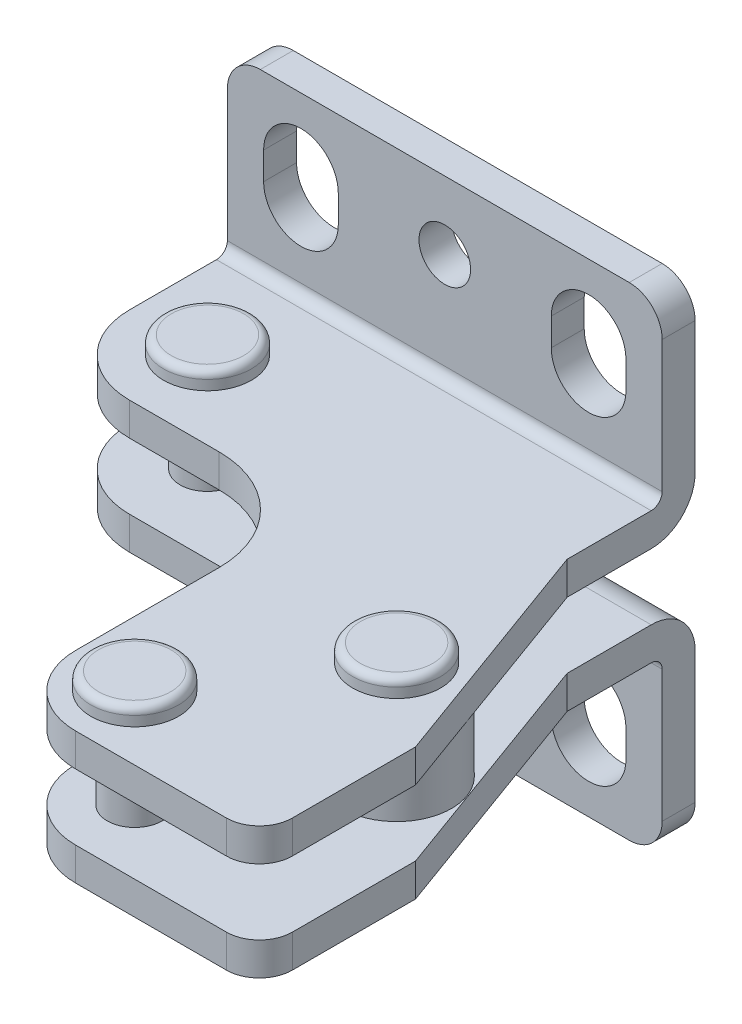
ISO-10303-21;
HEADER;
FILE_DESCRIPTION(('STEP AP214'),'2;1');
FILE_NAME('part.step','',(''),(''),'','','');
FILE_SCHEMA(('AUTOMOTIVE_DESIGN { 1 0 10303 214 1 1 1 1 }'));
ENDSEC;
DATA;
#1=APPLICATION_CONTEXT('core data for automotive mechanical design processes');
#2=APPLICATION_PROTOCOL_DEFINITION('international standard','automotive_design',2000,#1);
#3=PRODUCT_CONTEXT('',#1,'mechanical');
#4=PRODUCT('Part','Part','',(#3));
#5=PRODUCT_RELATED_PRODUCT_CATEGORY('part','',(#4));
#6=PRODUCT_DEFINITION_FORMATION('','',#4);
#7=PRODUCT_DEFINITION_CONTEXT('part definition',#1,'design');
#8=PRODUCT_DEFINITION('design','',#6,#7);
#9=PRODUCT_DEFINITION_SHAPE('','',#8);
#10=(LENGTH_UNIT() NAMED_UNIT(*) SI_UNIT(.MILLI.,.METRE.));
#11=(NAMED_UNIT(*) PLANE_ANGLE_UNIT() SI_UNIT($,.RADIAN.));
#12=(NAMED_UNIT(*) SI_UNIT($,.STERADIAN.) SOLID_ANGLE_UNIT());
#13=UNCERTAINTY_MEASURE_WITH_UNIT(LENGTH_MEASURE(1.E-05),#10,'distance_accuracy_value','');
#14=(GEOMETRIC_REPRESENTATION_CONTEXT(3) GLOBAL_UNCERTAINTY_ASSIGNED_CONTEXT((#13)) GLOBAL_UNIT_ASSIGNED_CONTEXT((#10,
#11,#12)) REPRESENTATION_CONTEXT('',''));
#15=CARTESIAN_POINT('',(0.,0.,0.));
#16=DIRECTION('',(0.,0.,1.));
#17=DIRECTION('',(1.,0.,0.));
#18=AXIS2_PLACEMENT_3D('',#15,#16,#17);
#19=CARTESIAN_POINT('',(0.,21.8,-1.89190363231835E-13));
#20=DIRECTION('',(0.,-1.,0.));
#21=DIRECTION('',(0.,0.,-1.));
#22=AXIS2_PLACEMENT_3D('',#19,#20,#21);
#23=PLANE('',#22);
#24=CARTESIAN_POINT('',(0.412000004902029,21.8,11.9228383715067));
#25=DIRECTION('',(0.,-1.,0.));
#26=DIRECTION('',(1.,0.,0.));
#27=AXIS2_PLACEMENT_3D('',#24,#25,#26);
#28=CIRCLE('',#27,4.);
#29=CARTESIAN_POINT('',(4.41200000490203,21.8,11.9228383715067));
#30=VERTEX_POINT('',#29);
#31=EDGE_CURVE('E1118',#30,#30,#28,.T.);
#32=ORIENTED_EDGE('',*,*,#31,.T.);
#33=EDGE_LOOP('',(#32));
#34=FACE_BOUND('',#33,.T.);
#35=CARTESIAN_POINT('',(33.2993999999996,21.8000000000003,27.5844383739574));
#36=DIRECTION('',(0.,1.,0.));
#37=DIRECTION('',(0.,0.,1.));
#38=AXIS2_PLACEMENT_3D('',#35,#36,#37);
#39=CIRCLE('',#38,4.);
#40=CARTESIAN_POINT('',(33.2993999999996,21.8000000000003,31.5844383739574));
#41=VERTEX_POINT('',#40);
#42=EDGE_CURVE('E1120',#41,#41,#39,.T.);
#43=ORIENTED_EDGE('',*,*,#42,.F.);
#44=EDGE_LOOP('',(#43));
#45=FACE_BOUND('',#44,.T.);
#46=CARTESIAN_POINT('',(23.6022,21.8000000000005,41.7424383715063));
#47=DIRECTION('',(0.,1.,0.));
#48=DIRECTION('',(0.,0.,1.));
#49=AXIS2_PLACEMENT_3D('',#46,#47,#48);
#50=CIRCLE('',#49,4.);
#51=CARTESIAN_POINT('',(23.6022,21.8000000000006,45.7424383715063));
#52=VERTEX_POINT('',#51);
#53=EDGE_CURVE('E1123',#52,#52,#50,.T.);
#54=ORIENTED_EDGE('',*,*,#53,.F.);
#55=EDGE_LOOP('',(#54));
#56=FACE_BOUND('',#55,.T.);
#57=DIRECTION('',(0.,0.,-1.));
#58=VECTOR('',#57,1.);
#59=CARTESIAN_POINT('',(-6.69999999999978,21.8000000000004,47.5844383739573));
#60=LINE('',#59,#58);
#61=CARTESIAN_POINT('',(-6.70000000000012,21.8,11.9228383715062));
#62=VERTEX_POINT('',#61);
#63=CARTESIAN_POINT('',(-6.7000000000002,21.8,3.9999999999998));
#64=VERTEX_POINT('',#63);
#65=EDGE_CURVE('E566',#62,#64,#60,.T.);
#66=ORIENTED_EDGE('',*,*,#65,.F.);
#67=CARTESIAN_POINT('',(0.412000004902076,21.8,11.9228383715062));
#68=DIRECTION('',(0.,-1.,0.));
#69=DIRECTION('',(0.,0.,-1.));
#70=AXIS2_PLACEMENT_3D('',#67,#68,#69);
#71=CIRCLE('',#70,7.1120000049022);
#72=CARTESIAN_POINT('',(0.412000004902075,21.8,19.0348383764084));
#73=VERTEX_POINT('',#72);
#74=EDGE_CURVE('E776',#62,#73,#71,.F.);
#75=ORIENTED_EDGE('',*,*,#74,.T.);
#76=DIRECTION('',(-1.,0.,0.));
#77=VECTOR('',#76,1.);
#78=CARTESIAN_POINT('',(17.7093999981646,21.8000000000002,19.0348383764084));
#79=LINE('',#78,#77);
#80=CARTESIAN_POINT('',(8.56540000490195,21.8,19.0348383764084));
#81=VERTEX_POINT('',#80);
#82=EDGE_CURVE('E484',#81,#73,#79,.T.);
#83=ORIENTED_EDGE('',*,*,#82,.F.);
#84=CARTESIAN_POINT('',(8.56540000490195,21.8000000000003,28.1788383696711));
#85=DIRECTION('',(0.,-1.,0.));
#86=DIRECTION('',(0.,0.,-1.));
#87=AXIS2_PLACEMENT_3D('',#84,#85,#86);
#88=CIRCLE('',#87,9.14399999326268);
#89=CARTESIAN_POINT('',(17.7093999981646,21.8000000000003,28.1788383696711));
#90=VERTEX_POINT('',#89);
#91=EDGE_CURVE('E793',#81,#90,#88,.T.);
#92=ORIENTED_EDGE('',*,*,#91,.T.);
#93=DIRECTION('',(0.,0.,-1.));
#94=VECTOR('',#93,1.);
#95=CARTESIAN_POINT('',(17.7093999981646,21.8000000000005,47.5844383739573));
#96=LINE('',#95,#94);
#97=CARTESIAN_POINT('',(17.7093999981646,21.8000000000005,41.234438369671));
#98=VERTEX_POINT('',#97);
#99=EDGE_CURVE('E483',#98,#90,#96,.T.);
#100=ORIENTED_EDGE('',*,*,#99,.F.);
#101=CARTESIAN_POINT('',(24.0594000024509,21.8000000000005,41.234438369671));
#102=DIRECTION('',(0.,-1.,0.));
#103=DIRECTION('',(0.,0.,-1.));
#104=AXIS2_PLACEMENT_3D('',#101,#102,#103);
#105=CIRCLE('',#104,6.35000000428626);
#106=CARTESIAN_POINT('',(24.0594000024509,21.8000000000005,47.5844383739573));
#107=VERTEX_POINT('',#106);
#108=EDGE_CURVE('E757',#98,#107,#105,.F.);
#109=ORIENTED_EDGE('',*,*,#108,.T.);
#110=DIRECTION('',(-1.,0.,0.));
#111=VECTOR('',#110,1.);
#112=CARTESIAN_POINT('',(40.7993999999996,21.8000000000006,47.5844383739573));
#113=LINE('',#112,#111);
#114=CARTESIAN_POINT('',(37.7993999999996,21.8000000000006,47.5844383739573));
#115=VERTEX_POINT('',#114);
#116=EDGE_CURVE('E562',#115,#107,#113,.T.);
#117=ORIENTED_EDGE('',*,*,#116,.F.);
#118=CARTESIAN_POINT('',(37.7993999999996,21.8000000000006,44.5844383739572));
#119=DIRECTION('',(0.,-1.,0.));
#120=DIRECTION('',(0.,0.,-1.));
#121=AXIS2_PLACEMENT_3D('',#118,#119,#120);
#122=CIRCLE('',#121,3.);
#123=CARTESIAN_POINT('',(40.7993999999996,21.8000000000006,44.5844383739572));
#124=VERTEX_POINT('',#123);
#125=EDGE_CURVE('E709',#115,#124,#122,.F.);
#126=ORIENTED_EDGE('',*,*,#125,.T.);
#127=DIRECTION('',(0.,0.,1.));
#128=VECTOR('',#127,1.);
#129=CARTESIAN_POINT('',(40.7993999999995,21.8,-1.87771609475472E-13));
#130=LINE('',#129,#128);
#131=CARTESIAN_POINT('',(40.7993999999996,21.8000000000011,33.3604383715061));
#132=VERTEX_POINT('',#131);
#133=EDGE_CURVE('E559',#132,#124,#130,.T.);
#134=ORIENTED_EDGE('',*,*,#133,.F.);
#135=DIRECTION('',(-0.342020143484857,0.,-0.939692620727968));
#136=VECTOR('',#135,1.);
#137=CARTESIAN_POINT('',(40.7993999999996,21.8000000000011,33.3604383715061));
#138=LINE('',#137,#136);
#139=CARTESIAN_POINT('',(32.8999999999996,21.8000000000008,11.6570152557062));
#140=VERTEX_POINT('',#139);
#141=EDGE_CURVE('E523',#132,#140,#138,.T.);
#142=ORIENTED_EDGE('',*,*,#141,.T.);
#143=DIRECTION('',(0.,0.,-1.));
#144=VECTOR('',#143,1.);
#145=CARTESIAN_POINT('',(32.8999999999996,21.8000000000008,11.6570152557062));
#146=LINE('',#145,#144);
#147=CARTESIAN_POINT('',(32.8999999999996,21.8000000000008,3.99999999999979));
#148=VERTEX_POINT('',#147);
#149=EDGE_CURVE('E526',#140,#148,#146,.T.);
#150=ORIENTED_EDGE('',*,*,#149,.T.);
#151=DIRECTION('',(1.,0.,0.));
#152=VECTOR('',#151,1.);
#153=CARTESIAN_POINT('',(-6.70000000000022,21.8,3.9999999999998));
#154=LINE('',#153,#152);
#155=EDGE_CURVE('E652',#148,#64,#154,.F.);
#156=ORIENTED_EDGE('',*,*,#155,.T.);
#157=EDGE_LOOP('',(#66,#75,#83,#92,#100,#109,#117,#126,#134,#142,#150,#156));
#158=FACE_BOUND('',#157,.T.);
#159=ADVANCED_FACE('F21',(#34,#45,#56,#158),#23,.F.);
#160=CARTESIAN_POINT('',(-6.70000000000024,21.8,-1.79268475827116E-13));
#161=DIRECTION('',(0.,0.,-1.));
#162=DIRECTION('',(0.,1.,0.));
#163=AXIS2_PLACEMENT_3D('',#160,#161,#162);
#164=PLANE('',#163);
#165=CARTESIAN_POINT('',(13.0999999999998,31.6,-3.26995375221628E-13));
#166=DIRECTION('',(0.,0.,1.));
#167=DIRECTION('',(1.,0.,0.));
#168=AXIS2_PLACEMENT_3D('',#165,#166,#167);
#169=CIRCLE('',#168,2.35000000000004);
#170=CARTESIAN_POINT('',(15.4499999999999,31.6,-3.26995375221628E-13));
#171=VERTEX_POINT('',#170);
#172=EDGE_CURVE('E1103',#171,#171,#169,.T.);
#173=ORIENTED_EDGE('',*,*,#172,.T.);
#174=EDGE_LOOP('',(#173));
#175=FACE_BOUND('',#174,.T.);
#176=CARTESIAN_POINT('',(26.1999999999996,31.6,-2.79324690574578E-13));
#177=DIRECTION('',(0.,0.,-1.));
#178=DIRECTION('',(0.,1.,0.));
#179=AXIS2_PLACEMENT_3D('',#176,#177,#178);
#180=CIRCLE('',#179,3.4);
#181=CARTESIAN_POINT('',(22.7999999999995,31.6,-2.78716037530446E-13));
#182=VERTEX_POINT('',#181);
#183=CARTESIAN_POINT('',(29.5999999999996,31.6000000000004,-2.70938638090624E-13));
#184=VERTEX_POINT('',#183);
#185=EDGE_CURVE('E412',#182,#184,#180,.T.);
#186=ORIENTED_EDGE('',*,*,#185,.F.);
#187=DIRECTION('',(0.,1.,0.));
#188=VECTOR('',#187,1.);
#189=CARTESIAN_POINT('',(22.7999999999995,29.1,-2.56988625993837E-13));
#190=LINE('',#189,#188);
#191=CARTESIAN_POINT('',(22.7999999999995,29.1,-2.56988625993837E-13));
#192=VERTEX_POINT('',#191);
#193=EDGE_CURVE('E426',#192,#182,#190,.T.);
#194=ORIENTED_EDGE('',*,*,#193,.F.);
#195=CARTESIAN_POINT('',(26.1999999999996,29.1,-2.57597279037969E-13));
#196=DIRECTION('',(0.,0.,-1.));
#197=DIRECTION('',(0.,1.,0.));
#198=AXIS2_PLACEMENT_3D('',#195,#196,#197);
#199=CIRCLE('',#198,3.4);
#200=CARTESIAN_POINT('',(29.5999999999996,29.1,-2.582059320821E-13));
#201=VERTEX_POINT('',#200);
#202=EDGE_CURVE('E423',#201,#192,#199,.T.);
#203=ORIENTED_EDGE('',*,*,#202,.F.);
#204=DIRECTION('',(0.,-1.,0.));
#205=VECTOR('',#204,1.);
#206=CARTESIAN_POINT('',(29.5999999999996,31.6,-2.79933343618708E-13));
#207=LINE('',#206,#205);
#208=EDGE_CURVE('E420',#184,#201,#207,.T.);
#209=ORIENTED_EDGE('',*,*,#208,.F.);
#210=EDGE_LOOP('',(#186,#194,#203,#209));
#211=FACE_BOUND('',#210,.T.);
#212=CARTESIAN_POINT('',(-1.10082660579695E-13,29.1,-3.28296417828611E-13));
#213=DIRECTION('',(0.,0.,1.));
#214=DIRECTION('',(1.,0.,0.));
#215=AXIS2_PLACEMENT_3D('',#212,#213,#214);
#216=CIRCLE('',#215,3.40000000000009);
#217=CARTESIAN_POINT('',(-3.40000000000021,29.1,-3.28296417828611E-13));
#218=VERTEX_POINT('',#217);
#219=CARTESIAN_POINT('',(3.4,29.1,-3.28296417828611E-13));
#220=VERTEX_POINT('',#219);
#221=EDGE_CURVE('E439',#218,#220,#216,.T.);
#222=ORIENTED_EDGE('',*,*,#221,.T.);
#223=DIRECTION('',(0.,1.,0.));
#224=VECTOR('',#223,1.);
#225=CARTESIAN_POINT('',(3.4,29.1,-3.28296417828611E-13));
#226=LINE('',#225,#224);
#227=CARTESIAN_POINT('',(3.4,31.6,-2.66248429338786E-13));
#228=VERTEX_POINT('',#227);
#229=EDGE_CURVE('E442',#220,#228,#226,.T.);
#230=ORIENTED_EDGE('',*,*,#229,.T.);
#231=CARTESIAN_POINT('',(-1.10494083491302E-13,31.6,-3.28296417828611E-13));
#232=DIRECTION('',(0.,0.,1.));
#233=DIRECTION('',(1.,0.,0.));
#234=AXIS2_PLACEMENT_3D('',#231,#232,#233);
#235=CIRCLE('',#234,3.40000000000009);
#236=CARTESIAN_POINT('',(-3.40000000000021,31.6,-3.28296417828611E-13));
#237=VERTEX_POINT('',#236);
#238=EDGE_CURVE('E446',#228,#237,#235,.T.);
#239=ORIENTED_EDGE('',*,*,#238,.T.);
#240=DIRECTION('',(0.,-1.,0.));
#241=VECTOR('',#240,1.);
#242=CARTESIAN_POINT('',(-3.40000000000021,31.6,-3.28296417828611E-13));
#243=LINE('',#242,#241);
#244=EDGE_CURVE('E449',#237,#218,#243,.T.);
#245=ORIENTED_EDGE('',*,*,#244,.T.);
#246=EDGE_LOOP('',(#222,#230,#239,#245));
#247=FACE_BOUND('',#246,.T.);
#248=DIRECTION('',(0.,-1.,0.));
#249=VECTOR('',#248,1.);
#250=CARTESIAN_POINT('',(32.8999999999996,21.8000000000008,-1.99756555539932E-13));
#251=LINE('',#250,#249);
#252=CARTESIAN_POINT('',(32.8999999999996,34.8,-3.1255045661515E-13));
#253=VERTEX_POINT('',#252);
#254=CARTESIAN_POINT('',(32.8999999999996,22.8,-2.0843300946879E-13));
#255=VERTEX_POINT('',#254);
#256=EDGE_CURVE('E535',#253,#255,#251,.T.);
#257=ORIENTED_EDGE('',*,*,#256,.T.);
#258=DIRECTION('',(1.,0.,0.));
#259=VECTOR('',#258,1.);
#260=CARTESIAN_POINT('',(-6.70000000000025,22.8,-1.87959485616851E-13));
#261=LINE('',#260,#259);
#262=CARTESIAN_POINT('',(-6.70000000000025,22.8,-1.87959485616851E-13));
#263=VERTEX_POINT('',#262);
#264=EDGE_CURVE('E730',#255,#263,#261,.F.);
#265=ORIENTED_EDGE('',*,*,#264,.T.);
#266=DIRECTION('',(0.,-1.,0.));
#267=VECTOR('',#266,1.);
#268=CARTESIAN_POINT('',(-6.70000000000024,21.8,-1.79268475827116E-13));
#269=LINE('',#268,#267);
#270=CARTESIAN_POINT('',(-6.70000000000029,34.8,-2.92251603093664E-13));
#271=VERTEX_POINT('',#270);
#272=EDGE_CURVE('E568',#271,#263,#269,.T.);
#273=ORIENTED_EDGE('',*,*,#272,.F.);
#274=CARTESIAN_POINT('',(-3.7000000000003,34.8,-2.9278864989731E-13));
#275=DIRECTION('',(0.,0.,-1.));
#276=DIRECTION('',(0.,1.,0.));
#277=AXIS2_PLACEMENT_3D('',#274,#275,#276);
#278=CIRCLE('',#277,3.);
#279=CARTESIAN_POINT('',(-3.7000000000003,37.8,-3.18856047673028E-13));
#280=VERTEX_POINT('',#279);
#281=EDGE_CURVE('E700',#271,#280,#278,.T.);
#282=ORIENTED_EDGE('',*,*,#281,.T.);
#283=DIRECTION('',(-1.,0.,0.));
#284=VECTOR('',#283,1.);
#285=CARTESIAN_POINT('',(-6.70000000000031,37.8,-3.18091032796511E-13));
#286=LINE('',#285,#284);
#287=CARTESIAN_POINT('',(29.8999999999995,37.8,-3.27424214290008E-13));
#288=VERTEX_POINT('',#287);
#289=EDGE_CURVE('E508',#288,#280,#286,.T.);
#290=ORIENTED_EDGE('',*,*,#289,.F.);
#291=CARTESIAN_POINT('',(29.8999999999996,34.8,-2.98803574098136E-13));
#292=DIRECTION('',(0.,0.,-1.));
#293=DIRECTION('',(0.,1.,0.));
#294=AXIS2_PLACEMENT_3D('',#291,#292,#293);
#295=CIRCLE('',#294,3.);
#296=EDGE_CURVE('E698',#288,#253,#295,.T.);
#297=ORIENTED_EDGE('',*,*,#296,.T.);
#298=EDGE_LOOP('',(#257,#265,#273,#282,#290,#297));
#299=FACE_BOUND('',#298,.T.);
#300=ADVANCED_FACE('F889',(#175,#211,#247,#299),#164,.T.);
#301=CARTESIAN_POINT('',(-6.69999999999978,21.8000000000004,47.5844383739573));
#302=DIRECTION('',(-1.,0.,0.));
#303=DIRECTION('',(0.,0.,1.));
#304=AXIS2_PLACEMENT_3D('',#301,#302,#303);
#305=PLANE('',#304);
#306=DIRECTION('',(0.,0.,-1.));
#307=VECTOR('',#306,1.);
#308=CARTESIAN_POINT('',(-6.69999999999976,18.8000000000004,47.5844383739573));
#309=LINE('',#308,#307);
#310=CARTESIAN_POINT('',(-6.70000000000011,18.8,11.9228383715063));
#311=VERTEX_POINT('',#310);
#312=CARTESIAN_POINT('',(-6.70000000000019,18.8,3.99999999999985));
#313=VERTEX_POINT('',#312);
#314=EDGE_CURVE('E563',#311,#313,#309,.T.);
#315=ORIENTED_EDGE('',*,*,#314,.F.);
#316=DIRECTION('',(0.,1.,0.));
#317=VECTOR('',#316,1.);
#318=CARTESIAN_POINT('',(-6.70000000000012,21.8,11.9228383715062));
#319=LINE('',#318,#317);
#320=EDGE_CURVE('E773',#311,#62,#319,.T.);
#321=ORIENTED_EDGE('',*,*,#320,.T.);
#322=ORIENTED_EDGE('',*,*,#65,.T.);
#323=CARTESIAN_POINT('',(-6.70000000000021,22.8,3.99999999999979));
#324=DIRECTION('',(-1.,0.,0.));
#325=DIRECTION('',(0.,0.,1.));
#326=AXIS2_PLACEMENT_3D('',#323,#324,#325);
#327=CIRCLE('',#326,1.);
#328=CARTESIAN_POINT('',(-6.70000000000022,22.8,2.99999999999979));
#329=VERTEX_POINT('',#328);
#330=EDGE_CURVE('E662',#64,#329,#327,.F.);
#331=ORIENTED_EDGE('',*,*,#330,.T.);
#332=DIRECTION('',(0.,-1.,0.));
#333=VECTOR('',#332,1.);
#334=CARTESIAN_POINT('',(-6.70000000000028,37.8,2.99999999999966));
#335=LINE('',#334,#333);
#336=CARTESIAN_POINT('',(-6.70000000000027,34.8,2.99999999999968));
#337=VERTEX_POINT('',#336);
#338=EDGE_CURVE('E520',#337,#329,#335,.T.);
#339=ORIENTED_EDGE('',*,*,#338,.F.);
#340=DIRECTION('',(0.,0.,1.));
#341=VECTOR('',#340,1.);
#342=CARTESIAN_POINT('',(-6.70000000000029,34.8,-2.90335457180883E-13));
#343=LINE('',#342,#341);
#344=EDGE_CURVE('E696',#337,#271,#343,.F.);
#345=ORIENTED_EDGE('',*,*,#344,.T.);
#346=ORIENTED_EDGE('',*,*,#272,.T.);
#347=CARTESIAN_POINT('',(-6.70000000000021,22.8,3.99999999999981));
#348=DIRECTION('',(-1.,0.,0.));
#349=DIRECTION('',(0.,0.,1.));
#350=AXIS2_PLACEMENT_3D('',#347,#348,#349);
#351=CIRCLE('',#350,4.);
#352=EDGE_CURVE('E732',#263,#313,#351,.T.);
#353=ORIENTED_EDGE('',*,*,#352,.T.);
#354=EDGE_LOOP('',(#315,#321,#322,#331,#339,#345,#346,#353));
#355=FACE_BOUND('',#354,.T.);
#356=ADVANCED_FACE('F896',(#355),#305,.T.);
#357=CARTESIAN_POINT('',(40.7993999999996,21.8000000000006,47.5844383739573));
#358=DIRECTION('',(0.,0.,1.));
#359=DIRECTION('',(0.,-1.,0.));
#360=AXIS2_PLACEMENT_3D('',#357,#358,#359);
#361=PLANE('',#360);
#362=ORIENTED_EDGE('',*,*,#116,.T.);
#363=DIRECTION('',(0.,1.,0.));
#364=VECTOR('',#363,1.);
#365=CARTESIAN_POINT('',(24.0594000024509,18.8000000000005,47.5844383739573));
#366=LINE('',#365,#364);
#367=CARTESIAN_POINT('',(24.0594000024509,18.8000000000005,47.5844383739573));
#368=VERTEX_POINT('',#367);
#369=EDGE_CURVE('E759',#107,#368,#366,.F.);
#370=ORIENTED_EDGE('',*,*,#369,.T.);
#371=DIRECTION('',(-1.,0.,0.));
#372=VECTOR('',#371,1.);
#373=CARTESIAN_POINT('',(40.7993999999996,18.8000000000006,47.5844383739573));
#374=LINE('',#373,#372);
#375=CARTESIAN_POINT('',(37.7993999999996,18.8000000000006,47.5844383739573));
#376=VERTEX_POINT('',#375);
#377=EDGE_CURVE('E571',#376,#368,#374,.T.);
#378=ORIENTED_EDGE('',*,*,#377,.F.);
#379=DIRECTION('',(0.,-1.,0.));
#380=VECTOR('',#379,1.);
#381=CARTESIAN_POINT('',(37.7993999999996,21.8000000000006,47.5844383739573));
#382=LINE('',#381,#380);
#383=EDGE_CURVE('E707',#376,#115,#382,.F.);
#384=ORIENTED_EDGE('',*,*,#383,.T.);
#385=EDGE_LOOP('',(#362,#370,#378,#384));
#386=FACE_BOUND('',#385,.T.);
#387=ADVANCED_FACE('F912',(#386),#361,.T.);
#388=CARTESIAN_POINT('',(40.7993999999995,21.8,-1.87771609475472E-13));
#389=DIRECTION('',(1.,0.,0.));
#390=DIRECTION('',(0.,1.,0.));
#391=AXIS2_PLACEMENT_3D('',#388,#389,#390);
#392=PLANE('',#391);
#393=ORIENTED_EDGE('',*,*,#133,.T.);
#394=DIRECTION('',(0.,-1.,0.));
#395=VECTOR('',#394,1.);
#396=CARTESIAN_POINT('',(40.7993999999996,21.8000000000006,44.5844383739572));
#397=LINE('',#396,#395);
#398=CARTESIAN_POINT('',(40.7993999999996,18.8000000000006,44.5844383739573));
#399=VERTEX_POINT('',#398);
#400=EDGE_CURVE('E702',#124,#399,#397,.T.);
#401=ORIENTED_EDGE('',*,*,#400,.T.);
#402=DIRECTION('',(0.,0.,1.));
#403=VECTOR('',#402,1.);
#404=CARTESIAN_POINT('',(40.7993999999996,18.8,-1.61698580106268E-13));
#405=LINE('',#404,#403);
#406=CARTESIAN_POINT('',(40.7993999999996,18.8000000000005,33.3604383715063));
#407=VERTEX_POINT('',#406);
#408=EDGE_CURVE('E558',#407,#399,#405,.T.);
#409=ORIENTED_EDGE('',*,*,#408,.F.);
#410=DIRECTION('',(0.,-1.,0.));
#411=VECTOR('',#410,1.);
#412=CARTESIAN_POINT('',(40.7993999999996,21.8000000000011,33.3604383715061));
#413=LINE('',#412,#411);
#414=EDGE_CURVE('E530',#132,#407,#413,.T.);
#415=ORIENTED_EDGE('',*,*,#414,.F.);
#416=EDGE_LOOP('',(#393,#401,#409,#415));
#417=FACE_BOUND('',#416,.T.);
#418=ADVANCED_FACE('F908',(#417),#392,.T.);
#419=CARTESIAN_POINT('',(0.,18.8,-1.63117333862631E-13));
#420=DIRECTION('',(0.,-1.,0.));
#421=DIRECTION('',(0.,0.,-1.));
#422=AXIS2_PLACEMENT_3D('',#419,#420,#421);
#423=PLANE('',#422);
#424=CARTESIAN_POINT('',(33.2994,18.8000000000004,27.5844383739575));
#425=DIRECTION('',(0.,-1.,0.));
#426=DIRECTION('',(0.,0.,-1.));
#427=AXIS2_PLACEMENT_3D('',#424,#425,#426);
#428=CIRCLE('',#427,5.);
#429=CARTESIAN_POINT('',(33.2994,18.8000000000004,22.5844383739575));
#430=VERTEX_POINT('',#429);
#431=EDGE_CURVE('E11',#430,#430,#428,.T.);
#432=ORIENTED_EDGE('',*,*,#431,.F.);
#433=EDGE_LOOP('',(#432));
#434=FACE_BOUND('',#433,.T.);
#435=DIRECTION('',(0.,0.,-1.));
#436=VECTOR('',#435,1.);
#437=CARTESIAN_POINT('',(17.7093999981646,18.8000000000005,47.5844383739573));
#438=LINE('',#437,#436);
#439=CARTESIAN_POINT('',(17.7093999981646,18.8000000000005,41.234438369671));
#440=VERTEX_POINT('',#439);
#441=CARTESIAN_POINT('',(17.7093999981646,18.8000000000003,28.1788383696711));
#442=VERTEX_POINT('',#441);
#443=EDGE_CURVE('E480',#440,#442,#438,.T.);
#444=ORIENTED_EDGE('',*,*,#443,.T.);
#445=CARTESIAN_POINT('',(8.56540000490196,18.8000000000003,28.1788383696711));
#446=DIRECTION('',(0.,-1.,0.));
#447=DIRECTION('',(0.,0.,-1.));
#448=AXIS2_PLACEMENT_3D('',#445,#446,#447);
#449=CIRCLE('',#448,9.14399999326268);
#450=CARTESIAN_POINT('',(8.56540000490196,18.8,19.0348383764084));
#451=VERTEX_POINT('',#450);
#452=EDGE_CURVE('E795',#442,#451,#449,.F.);
#453=ORIENTED_EDGE('',*,*,#452,.T.);
#454=DIRECTION('',(-1.,0.,0.));
#455=VECTOR('',#454,1.);
#456=CARTESIAN_POINT('',(17.7093999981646,18.8000000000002,19.0348383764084));
#457=LINE('',#456,#455);
#458=CARTESIAN_POINT('',(0.412000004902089,18.8,19.0348383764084));
#459=VERTEX_POINT('',#458);
#460=EDGE_CURVE('E479',#451,#459,#457,.T.);
#461=ORIENTED_EDGE('',*,*,#460,.T.);
#462=CARTESIAN_POINT('',(0.412000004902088,18.8,11.9228383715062));
#463=DIRECTION('',(0.,-1.,0.));
#464=DIRECTION('',(0.,0.,-1.));
#465=AXIS2_PLACEMENT_3D('',#462,#463,#464);
#466=CIRCLE('',#465,7.1120000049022);
#467=EDGE_CURVE('E782',#459,#311,#466,.T.);
#468=ORIENTED_EDGE('',*,*,#467,.T.);
#469=ORIENTED_EDGE('',*,*,#314,.T.);
#470=DIRECTION('',(1.,0.,0.));
#471=VECTOR('',#470,1.);
#472=CARTESIAN_POINT('',(0.,18.8,3.99999999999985));
#473=LINE('',#472,#471);
#474=CARTESIAN_POINT('',(32.8999999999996,18.8,3.99999999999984));
#475=VERTEX_POINT('',#474);
#476=EDGE_CURVE('E725',#313,#475,#473,.T.);
#477=ORIENTED_EDGE('',*,*,#476,.T.);
#478=DIRECTION('',(0.,0.,-1.));
#479=VECTOR('',#478,1.);
#480=CARTESIAN_POINT('',(32.8999999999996,18.8000000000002,11.6570152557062));
#481=LINE('',#480,#479);
#482=CARTESIAN_POINT('',(32.8999999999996,18.8000000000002,11.6570152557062));
#483=VERTEX_POINT('',#482);
#484=EDGE_CURVE('E527',#483,#475,#481,.T.);
#485=ORIENTED_EDGE('',*,*,#484,.F.);
#486=DIRECTION('',(-0.342020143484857,0.,-0.939692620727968));
#487=VECTOR('',#486,1.);
#488=CARTESIAN_POINT('',(40.7993999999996,18.8000000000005,33.3604383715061));
#489=LINE('',#488,#487);
#490=EDGE_CURVE('E522',#407,#483,#489,.T.);
#491=ORIENTED_EDGE('',*,*,#490,.F.);
#492=ORIENTED_EDGE('',*,*,#408,.T.);
#493=CARTESIAN_POINT('',(37.7993999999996,18.8000000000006,44.5844383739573));
#494=DIRECTION('',(0.,-1.,0.));
#495=DIRECTION('',(0.,0.,-1.));
#496=AXIS2_PLACEMENT_3D('',#493,#494,#495);
#497=CIRCLE('',#496,3.);
#498=EDGE_CURVE('E705',#399,#376,#497,.T.);
#499=ORIENTED_EDGE('',*,*,#498,.T.);
#500=ORIENTED_EDGE('',*,*,#377,.T.);
#501=CARTESIAN_POINT('',(24.0594000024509,18.8000000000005,41.234438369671));
#502=DIRECTION('',(0.,-1.,0.));
#503=DIRECTION('',(0.,0.,-1.));
#504=AXIS2_PLACEMENT_3D('',#501,#502,#503);
#505=CIRCLE('',#504,6.35000000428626);
#506=EDGE_CURVE('E761',#368,#440,#505,.T.);
#507=ORIENTED_EDGE('',*,*,#506,.T.);
#508=EDGE_LOOP('',(#444,#453,#461,#468,#469,#477,#485,#491,#492,#499,#500,#507));
#509=FACE_BOUND('',#508,.T.);
#510=ADVANCED_FACE('F904',(#434,#509),#423,.T.);
#511=CARTESIAN_POINT('',(32.8999999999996,21.8000000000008,11.6570152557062));
#512=DIRECTION('',(-1.,0.,0.));
#513=DIRECTION('',(0.,-1.,0.));
#514=AXIS2_PLACEMENT_3D('',#511,#512,#513);
#515=PLANE('',#514);
#516=ORIENTED_EDGE('',*,*,#484,.T.);
#517=CARTESIAN_POINT('',(32.8999999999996,22.8,3.99999999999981));
#518=DIRECTION('',(-1.,0.,0.));
#519=DIRECTION('',(0.,-1.,0.));
#520=AXIS2_PLACEMENT_3D('',#517,#518,#519);
#521=CIRCLE('',#520,4.);
#522=EDGE_CURVE('E728',#475,#255,#521,.F.);
#523=ORIENTED_EDGE('',*,*,#522,.T.);
#524=ORIENTED_EDGE('',*,*,#256,.F.);
#525=DIRECTION('',(0.,0.,-1.));
#526=VECTOR('',#525,1.);
#527=CARTESIAN_POINT('',(32.8999999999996,34.8,11.657015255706));
#528=LINE('',#527,#526);
#529=CARTESIAN_POINT('',(32.8999999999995,34.8,2.99999999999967));
#530=VERTEX_POINT('',#529);
#531=EDGE_CURVE('E723',#253,#530,#528,.F.);
#532=ORIENTED_EDGE('',*,*,#531,.T.);
#533=DIRECTION('',(0.,-1.,0.));
#534=VECTOR('',#533,1.);
#535=CARTESIAN_POINT('',(32.8999999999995,37.8,2.99999999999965));
#536=LINE('',#535,#534);
#537=CARTESIAN_POINT('',(32.8999999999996,22.8,2.99999999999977));
#538=VERTEX_POINT('',#537);
#539=EDGE_CURVE('E518',#530,#538,#536,.T.);
#540=ORIENTED_EDGE('',*,*,#539,.T.);
#541=CARTESIAN_POINT('',(32.8999999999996,22.8,3.99999999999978));
#542=DIRECTION('',(-1.,0.,0.));
#543=DIRECTION('',(0.,-1.,0.));
#544=AXIS2_PLACEMENT_3D('',#541,#542,#543);
#545=CIRCLE('',#544,1.);
#546=EDGE_CURVE('E660',#538,#148,#545,.T.);
#547=ORIENTED_EDGE('',*,*,#546,.T.);
#548=ORIENTED_EDGE('',*,*,#149,.F.);
#549=DIRECTION('',(0.,-1.,0.));
#550=VECTOR('',#549,1.);
#551=CARTESIAN_POINT('',(32.8999999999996,21.8000000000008,11.6570152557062));
#552=LINE('',#551,#550);
#553=EDGE_CURVE('E539',#140,#483,#552,.T.);
#554=ORIENTED_EDGE('',*,*,#553,.T.);
#555=EDGE_LOOP('',(#516,#523,#524,#532,#540,#547,#548,#554));
#556=FACE_BOUND('',#555,.T.);
#557=ADVANCED_FACE('F907',(#556),#515,.F.);
#558=CARTESIAN_POINT('',(40.7993999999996,21.8000000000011,33.3604383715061));
#559=DIRECTION('',(-0.939692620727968,0.,0.342020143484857));
#560=DIRECTION('',(0.342020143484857,0.,0.939692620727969));
#561=AXIS2_PLACEMENT_3D('',#558,#559,#560);
#562=PLANE('',#561);
#563=ORIENTED_EDGE('',*,*,#490,.T.);
#564=ORIENTED_EDGE('',*,*,#553,.F.);
#565=ORIENTED_EDGE('',*,*,#141,.F.);
#566=ORIENTED_EDGE('',*,*,#414,.T.);
#567=EDGE_LOOP('',(#563,#564,#565,#566));
#568=FACE_BOUND('',#567,.T.);
#569=ADVANCED_FACE('F1033',(#568),#562,.F.);
#570=CARTESIAN_POINT('',(32.8999999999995,37.8,2.99999999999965));
#571=DIRECTION('',(0.,0.,-1.));
#572=DIRECTION('',(0.,1.,0.));
#573=AXIS2_PLACEMENT_3D('',#570,#571,#572);
#574=PLANE('',#573);
#575=CARTESIAN_POINT('',(13.0999999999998,31.6,3.));
#576=DIRECTION('',(0.,0.,1.));
#577=DIRECTION('',(1.,0.,0.));
#578=AXIS2_PLACEMENT_3D('',#575,#576,#577);
#579=CIRCLE('',#578,2.35000000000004);
#580=CARTESIAN_POINT('',(15.4499999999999,31.6,3.));
#581=VERTEX_POINT('',#580);
#582=EDGE_CURVE('E1109',#581,#581,#579,.T.);
#583=ORIENTED_EDGE('',*,*,#582,.F.);
#584=EDGE_LOOP('',(#583));
#585=FACE_BOUND('',#584,.T.);
#586=DIRECTION('',(0.,1.,0.));
#587=VECTOR('',#586,1.);
#588=CARTESIAN_POINT('',(22.7999999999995,37.8,2.99999999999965));
#589=LINE('',#588,#587);
#590=CARTESIAN_POINT('',(22.7999999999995,29.1,2.99999999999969));
#591=VERTEX_POINT('',#590);
#592=CARTESIAN_POINT('',(22.7999999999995,31.6,2.99999999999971));
#593=VERTEX_POINT('',#592);
#594=EDGE_CURVE('E583',#591,#593,#589,.T.);
#595=ORIENTED_EDGE('',*,*,#594,.T.);
#596=CARTESIAN_POINT('',(26.1999999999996,31.6,2.9999999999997));
#597=DIRECTION('',(0.,0.,-1.));
#598=DIRECTION('',(0.,1.,0.));
#599=AXIS2_PLACEMENT_3D('',#596,#597,#598);
#600=CIRCLE('',#599,3.4);
#601=CARTESIAN_POINT('',(29.5999999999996,31.6,2.99999999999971));
#602=VERTEX_POINT('',#601);
#603=EDGE_CURVE('E586',#593,#602,#600,.T.);
#604=ORIENTED_EDGE('',*,*,#603,.T.);
#605=DIRECTION('',(0.,-1.,0.));
#606=VECTOR('',#605,1.);
#607=CARTESIAN_POINT('',(29.5999999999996,37.8,2.99999999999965));
#608=LINE('',#607,#606);
#609=CARTESIAN_POINT('',(29.5999999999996,29.1,2.99999999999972));
#610=VERTEX_POINT('',#609);
#611=EDGE_CURVE('E577',#602,#610,#608,.T.);
#612=ORIENTED_EDGE('',*,*,#611,.T.);
#613=CARTESIAN_POINT('',(26.1999999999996,29.1,2.99999999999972));
#614=DIRECTION('',(0.,0.,-1.));
#615=DIRECTION('',(0.,1.,0.));
#616=AXIS2_PLACEMENT_3D('',#613,#614,#615);
#617=CIRCLE('',#616,3.4);
#618=EDGE_CURVE('E580',#610,#591,#617,.T.);
#619=ORIENTED_EDGE('',*,*,#618,.T.);
#620=EDGE_LOOP('',(#595,#604,#612,#619));
#621=FACE_BOUND('',#620,.T.);
#622=DIRECTION('',(0.,1.,0.));
#623=VECTOR('',#622,1.);
#624=CARTESIAN_POINT('',(3.4,29.1,3.));
#625=LINE('',#624,#623);
#626=CARTESIAN_POINT('',(3.4,29.1,2.99999999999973));
#627=VERTEX_POINT('',#626);
#628=CARTESIAN_POINT('',(3.4,31.6,3.));
#629=VERTEX_POINT('',#628);
#630=EDGE_CURVE('E454',#627,#629,#625,.T.);
#631=ORIENTED_EDGE('',*,*,#630,.F.);
#632=CARTESIAN_POINT('',(-1.10082660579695E-13,29.1,3.));
#633=DIRECTION('',(0.,0.,1.));
#634=DIRECTION('',(1.,0.,0.));
#635=AXIS2_PLACEMENT_3D('',#632,#633,#634);
#636=CIRCLE('',#635,3.40000000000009);
#637=CARTESIAN_POINT('',(-3.40000000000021,29.1,3.));
#638=VERTEX_POINT('',#637);
#639=EDGE_CURVE('E432',#638,#627,#636,.T.);
#640=ORIENTED_EDGE('',*,*,#639,.F.);
#641=DIRECTION('',(0.,-1.,0.));
#642=VECTOR('',#641,1.);
#643=CARTESIAN_POINT('',(-3.40000000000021,31.6,3.));
#644=LINE('',#643,#642);
#645=CARTESIAN_POINT('',(-3.40000000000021,31.6,3.));
#646=VERTEX_POINT('',#645);
#647=EDGE_CURVE('E443',#646,#638,#644,.T.);
#648=ORIENTED_EDGE('',*,*,#647,.F.);
#649=CARTESIAN_POINT('',(-1.10494083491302E-13,31.6,3.));
#650=DIRECTION('',(0.,0.,1.));
#651=DIRECTION('',(1.,0.,0.));
#652=AXIS2_PLACEMENT_3D('',#649,#650,#651);
#653=CIRCLE('',#652,3.40000000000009);
#654=EDGE_CURVE('E457',#629,#646,#653,.T.);
#655=ORIENTED_EDGE('',*,*,#654,.F.);
#656=EDGE_LOOP('',(#631,#640,#648,#655));
#657=FACE_BOUND('',#656,.T.);
#658=DIRECTION('',(1.,0.,0.));
#659=VECTOR('',#658,1.);
#660=CARTESIAN_POINT('',(32.8999999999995,37.8,2.99999999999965));
#661=LINE('',#660,#659);
#662=CARTESIAN_POINT('',(-3.70000000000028,37.8,2.99999999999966));
#663=VERTEX_POINT('',#662);
#664=CARTESIAN_POINT('',(29.8999999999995,37.8,2.99999999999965));
#665=VERTEX_POINT('',#664);
#666=EDGE_CURVE('E515',#663,#665,#661,.T.);
#667=ORIENTED_EDGE('',*,*,#666,.F.);
#668=CARTESIAN_POINT('',(-3.70000000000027,34.8,2.99999999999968));
#669=DIRECTION('',(0.,0.,-1.));
#670=DIRECTION('',(0.,1.,0.));
#671=AXIS2_PLACEMENT_3D('',#668,#669,#670);
#672=CIRCLE('',#671,3.);
#673=EDGE_CURVE('E694',#663,#337,#672,.F.);
#674=ORIENTED_EDGE('',*,*,#673,.T.);
#675=ORIENTED_EDGE('',*,*,#338,.T.);
#676=DIRECTION('',(1.,0.,0.));
#677=VECTOR('',#676,1.);
#678=CARTESIAN_POINT('',(32.8999999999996,22.8,2.99999999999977));
#679=LINE('',#678,#677);
#680=EDGE_CURVE('E649',#329,#538,#679,.T.);
#681=ORIENTED_EDGE('',*,*,#680,.T.);
#682=ORIENTED_EDGE('',*,*,#539,.F.);
#683=CARTESIAN_POINT('',(29.8999999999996,34.8,2.99999999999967));
#684=DIRECTION('',(0.,0.,-1.));
#685=DIRECTION('',(0.,1.,0.));
#686=AXIS2_PLACEMENT_3D('',#683,#684,#685);
#687=CIRCLE('',#686,3.);
#688=EDGE_CURVE('E692',#530,#665,#687,.F.);
#689=ORIENTED_EDGE('',*,*,#688,.T.);
#690=EDGE_LOOP('',(#667,#674,#675,#681,#682,#689));
#691=FACE_BOUND('',#690,.T.);
#692=ADVANCED_FACE('F1058',(#585,#621,#657,#691),#574,.F.);
#693=CARTESIAN_POINT('',(-1.41729966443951E-13,37.8,-3.40513779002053E-13));
#694=DIRECTION('',(0.,-1.,0.));
#695=DIRECTION('',(0.,0.,-1.));
#696=AXIS2_PLACEMENT_3D('',#693,#694,#695);
#697=PLANE('',#696);
#698=ORIENTED_EDGE('',*,*,#289,.T.);
#699=DIRECTION('',(0.,0.,1.));
#700=VECTOR('',#699,1.);
#701=CARTESIAN_POINT('',(-3.70000000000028,37.8,2.99999999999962));
#702=LINE('',#701,#700);
#703=EDGE_CURVE('E689',#280,#663,#702,.T.);
#704=ORIENTED_EDGE('',*,*,#703,.T.);
#705=ORIENTED_EDGE('',*,*,#666,.T.);
#706=DIRECTION('',(0.,0.,-1.));
#707=VECTOR('',#706,1.);
#708=CARTESIAN_POINT('',(29.8999999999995,37.8,-3.40513779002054E-13));
#709=LINE('',#708,#707);
#710=EDGE_CURVE('E686',#665,#288,#709,.T.);
#711=ORIENTED_EDGE('',*,*,#710,.T.);
#712=EDGE_LOOP('',(#698,#704,#705,#711));
#713=FACE_BOUND('',#712,.T.);
#714=ADVANCED_FACE('F1063',(#713),#697,.F.);
#715=CARTESIAN_POINT('',(17.7093999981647,-6.20100000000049,19.0348383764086));
#716=DIRECTION('',(0.,0.,-1.));
#717=DIRECTION('',(0.,1.,0.));
#718=AXIS2_PLACEMENT_3D('',#715,#716,#717);
#719=PLANE('',#718);
#720=ORIENTED_EDGE('',*,*,#460,.F.);
#721=DIRECTION('',(0.,1.,0.));
#722=VECTOR('',#721,1.);
#723=CARTESIAN_POINT('',(8.56540000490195,21.8,19.0348383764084));
#724=LINE('',#723,#722);
#725=EDGE_CURVE('E784',#451,#81,#724,.T.);
#726=ORIENTED_EDGE('',*,*,#725,.T.);
#727=ORIENTED_EDGE('',*,*,#82,.T.);
#728=DIRECTION('',(0.,1.,0.));
#729=VECTOR('',#728,1.);
#730=CARTESIAN_POINT('',(0.412000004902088,18.8,19.0348383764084));
#731=LINE('',#730,#729);
#732=EDGE_CURVE('E779',#73,#459,#731,.F.);
#733=ORIENTED_EDGE('',*,*,#732,.T.);
#734=EDGE_LOOP('',(#720,#726,#727,#733));
#735=FACE_BOUND('',#734,.T.);
#736=ADVANCED_FACE('F1016',(#735),#719,.F.);
#737=CARTESIAN_POINT('',(17.7093999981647,-6.20100000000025,47.5844383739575));
#738=DIRECTION('',(1.,0.,0.));
#739=DIRECTION('',(0.,1.,0.));
#740=AXIS2_PLACEMENT_3D('',#737,#738,#739);
#741=PLANE('',#740);
#742=ORIENTED_EDGE('',*,*,#99,.T.);
#743=DIRECTION('',(0.,1.,0.));
#744=VECTOR('',#743,1.);
#745=CARTESIAN_POINT('',(17.7093999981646,18.8000000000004,28.1788383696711));
#746=LINE('',#745,#744);
#747=EDGE_CURVE('E787',#90,#442,#746,.F.);
#748=ORIENTED_EDGE('',*,*,#747,.T.);
#749=ORIENTED_EDGE('',*,*,#443,.F.);
#750=DIRECTION('',(0.,1.,0.));
#751=VECTOR('',#750,1.);
#752=CARTESIAN_POINT('',(17.7093999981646,21.8000000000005,41.234438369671));
#753=LINE('',#752,#751);
#754=EDGE_CURVE('E754',#440,#98,#753,.T.);
#755=ORIENTED_EDGE('',*,*,#754,.T.);
#756=EDGE_LOOP('',(#742,#748,#749,#755));
#757=FACE_BOUND('',#756,.T.);
#758=ADVANCED_FACE('F1046',(#757),#741,.F.);
#759=CARTESIAN_POINT('',(-1.10082660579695E-13,29.1,-3.28296417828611E-13));
#760=DIRECTION('',(0.,0.,1.));
#761=DIRECTION('',(1.,0.,0.));
#762=AXIS2_PLACEMENT_3D('',#759,#760,#761);
#763=CYLINDRICAL_SURFACE('',#762,3.40000000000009);
#764=ORIENTED_EDGE('',*,*,#639,.T.);
#765=DIRECTION('',(0.,0.,1.));
#766=VECTOR('',#765,1.);
#767=CARTESIAN_POINT('',(3.4,29.1,-3.28296417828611E-13));
#768=LINE('',#767,#766);
#769=EDGE_CURVE('E452',#220,#627,#768,.T.);
#770=ORIENTED_EDGE('',*,*,#769,.F.);
#771=ORIENTED_EDGE('',*,*,#221,.F.);
#772=DIRECTION('',(0.,0.,1.));
#773=VECTOR('',#772,1.);
#774=CARTESIAN_POINT('',(-3.40000000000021,29.1,-3.28296417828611E-13));
#775=LINE('',#774,#773);
#776=EDGE_CURVE('E462',#218,#638,#775,.T.);
#777=ORIENTED_EDGE('',*,*,#776,.T.);
#778=EDGE_LOOP('',(#764,#770,#771,#777));
#779=FACE_BOUND('',#778,.T.);
#780=ADVANCED_FACE('F1201',(#779),#763,.F.);
#781=CARTESIAN_POINT('',(-3.40000000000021,31.6,-3.28296417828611E-13));
#782=DIRECTION('',(-1.,0.,0.));
#783=DIRECTION('',(0.,0.,1.));
#784=AXIS2_PLACEMENT_3D('',#781,#782,#783);
#785=PLANE('',#784);
#786=ORIENTED_EDGE('',*,*,#647,.T.);
#787=ORIENTED_EDGE('',*,*,#776,.F.);
#788=ORIENTED_EDGE('',*,*,#244,.F.);
#789=DIRECTION('',(0.,0.,1.));
#790=VECTOR('',#789,1.);
#791=CARTESIAN_POINT('',(-3.40000000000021,31.6,-3.28296417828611E-13));
#792=LINE('',#791,#790);
#793=EDGE_CURVE('E465',#237,#646,#792,.T.);
#794=ORIENTED_EDGE('',*,*,#793,.T.);
#795=EDGE_LOOP('',(#786,#787,#788,#794));
#796=FACE_BOUND('',#795,.T.);
#797=ADVANCED_FACE('F1197',(#796),#785,.F.);
#798=CARTESIAN_POINT('',(-1.10494083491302E-13,31.6,-3.28296417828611E-13));
#799=DIRECTION('',(0.,0.,1.));
#800=DIRECTION('',(1.,0.,0.));
#801=AXIS2_PLACEMENT_3D('',#798,#799,#800);
#802=CYLINDRICAL_SURFACE('',#801,3.40000000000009);
#803=ORIENTED_EDGE('',*,*,#654,.T.);
#804=ORIENTED_EDGE('',*,*,#793,.F.);
#805=ORIENTED_EDGE('',*,*,#238,.F.);
#806=DIRECTION('',(0.,0.,1.));
#807=VECTOR('',#806,1.);
#808=CARTESIAN_POINT('',(3.4,31.6,-3.28296417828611E-13));
#809=LINE('',#808,#807);
#810=EDGE_CURVE('E467',#228,#629,#809,.T.);
#811=ORIENTED_EDGE('',*,*,#810,.T.);
#812=EDGE_LOOP('',(#803,#804,#805,#811));
#813=FACE_BOUND('',#812,.T.);
#814=ADVANCED_FACE('F1200',(#813),#802,.F.);
#815=CARTESIAN_POINT('',(3.4,29.1,-3.28296417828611E-13));
#816=DIRECTION('',(1.,0.,0.));
#817=DIRECTION('',(0.,0.,-1.));
#818=AXIS2_PLACEMENT_3D('',#815,#816,#817);
#819=PLANE('',#818);
#820=ORIENTED_EDGE('',*,*,#630,.T.);
#821=ORIENTED_EDGE('',*,*,#810,.F.);
#822=ORIENTED_EDGE('',*,*,#229,.F.);
#823=ORIENTED_EDGE('',*,*,#769,.T.);
#824=EDGE_LOOP('',(#820,#821,#822,#823));
#825=FACE_BOUND('',#824,.T.);
#826=ADVANCED_FACE('F1195',(#825),#819,.F.);
#827=CARTESIAN_POINT('',(26.1999999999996,31.6000000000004,47.5844383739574));
#828=DIRECTION('',(0.,0.,-1.));
#829=DIRECTION('',(0.,1.,0.));
#830=AXIS2_PLACEMENT_3D('',#827,#828,#829);
#831=CYLINDRICAL_SURFACE('',#830,3.4);
#832=DIRECTION('',(0.,0.,-1.));
#833=VECTOR('',#832,1.);
#834=CARTESIAN_POINT('',(22.7999999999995,31.6000000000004,47.5844383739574));
#835=LINE('',#834,#833);
#836=EDGE_CURVE('E430',#593,#182,#835,.T.);
#837=ORIENTED_EDGE('',*,*,#836,.T.);
#838=ORIENTED_EDGE('',*,*,#185,.T.);
#839=DIRECTION('',(0.,0.,-1.));
#840=VECTOR('',#839,1.);
#841=CARTESIAN_POINT('',(29.5999999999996,31.6000000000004,47.5844383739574));
#842=LINE('',#841,#840);
#843=EDGE_CURVE('E429',#602,#184,#842,.T.);
#844=ORIENTED_EDGE('',*,*,#843,.F.);
#845=ORIENTED_EDGE('',*,*,#603,.F.);
#846=EDGE_LOOP('',(#837,#838,#844,#845));
#847=FACE_BOUND('',#846,.T.);
#848=ADVANCED_FACE('F1183',(#847),#831,.F.);
#849=CARTESIAN_POINT('',(22.7999999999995,29.1000000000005,47.5844383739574));
#850=DIRECTION('',(-1.,0.,0.));
#851=DIRECTION('',(0.,0.,1.));
#852=AXIS2_PLACEMENT_3D('',#849,#850,#851);
#853=PLANE('',#852);
#854=DIRECTION('',(0.,0.,-1.));
#855=VECTOR('',#854,1.);
#856=CARTESIAN_POINT('',(22.7999999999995,29.1000000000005,47.5844383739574));
#857=LINE('',#856,#855);
#858=EDGE_CURVE('E433',#591,#192,#857,.T.);
#859=ORIENTED_EDGE('',*,*,#858,.T.);
#860=ORIENTED_EDGE('',*,*,#193,.T.);
#861=ORIENTED_EDGE('',*,*,#836,.F.);
#862=ORIENTED_EDGE('',*,*,#594,.F.);
#863=EDGE_LOOP('',(#859,#860,#861,#862));
#864=FACE_BOUND('',#863,.T.);
#865=ADVANCED_FACE('F1179',(#864),#853,.F.);
#866=CARTESIAN_POINT('',(26.1999999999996,29.1000000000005,47.5844383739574));
#867=DIRECTION('',(0.,0.,-1.));
#868=DIRECTION('',(0.,1.,0.));
#869=AXIS2_PLACEMENT_3D('',#866,#867,#868);
#870=CYLINDRICAL_SURFACE('',#869,3.4);
#871=DIRECTION('',(0.,0.,-1.));
#872=VECTOR('',#871,1.);
#873=CARTESIAN_POINT('',(29.5999999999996,29.1000000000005,47.5844383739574));
#874=LINE('',#873,#872);
#875=EDGE_CURVE('E435',#610,#201,#874,.T.);
#876=ORIENTED_EDGE('',*,*,#875,.T.);
#877=ORIENTED_EDGE('',*,*,#202,.T.);
#878=ORIENTED_EDGE('',*,*,#858,.F.);
#879=ORIENTED_EDGE('',*,*,#618,.F.);
#880=EDGE_LOOP('',(#876,#877,#878,#879));
#881=FACE_BOUND('',#880,.T.);
#882=ADVANCED_FACE('F1182',(#881),#870,.F.);
#883=CARTESIAN_POINT('',(29.5999999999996,31.6000000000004,47.5844383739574));
#884=DIRECTION('',(1.,0.,0.));
#885=DIRECTION('',(0.,0.,-1.));
#886=AXIS2_PLACEMENT_3D('',#883,#884,#885);
#887=PLANE('',#886);
#888=ORIENTED_EDGE('',*,*,#843,.T.);
#889=ORIENTED_EDGE('',*,*,#208,.T.);
#890=ORIENTED_EDGE('',*,*,#875,.F.);
#891=ORIENTED_EDGE('',*,*,#611,.F.);
#892=EDGE_LOOP('',(#888,#889,#890,#891));
#893=FACE_BOUND('',#892,.T.);
#894=ADVANCED_FACE('F1187',(#893),#887,.F.);
#895=CARTESIAN_POINT('',(23.6022,23.4000000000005,41.7424383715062));
#896=DIRECTION('',(0.,1.,0.));
#897=DIRECTION('',(0.,0.,1.));
#898=AXIS2_PLACEMENT_3D('',#895,#896,#897);
#899=PLANE('',#898);
#900=CARTESIAN_POINT('',(23.6022,23.4000000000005,41.7424383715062));
#901=DIRECTION('',(0.,1.,0.));
#902=DIRECTION('',(0.,0.,1.));
#903=AXIS2_PLACEMENT_3D('',#900,#901,#902);
#904=CIRCLE('',#903,3.3);
#905=CARTESIAN_POINT('',(23.6022,23.4000000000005,45.0424383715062));
#906=VERTEX_POINT('',#905);
#907=EDGE_CURVE('E619',#906,#906,#904,.T.);
#908=ORIENTED_EDGE('',*,*,#907,.T.);
#909=EDGE_LOOP('',(#908));
#910=FACE_BOUND('',#909,.T.);
#911=ADVANCED_FACE('F1191',(#910),#899,.T.);
#912=CARTESIAN_POINT('',(23.6022,21.8000000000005,41.7424383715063));
#913=DIRECTION('',(0.,1.,0.));
#914=DIRECTION('',(0.,0.,1.));
#915=AXIS2_PLACEMENT_3D('',#912,#913,#914);
#916=CYLINDRICAL_SURFACE('',#915,4.);
#917=CARTESIAN_POINT('',(23.6022,22.7000000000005,41.7424383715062));
#918=DIRECTION('',(0.,1.,0.));
#919=DIRECTION('',(0.,0.,1.));
#920=AXIS2_PLACEMENT_3D('',#917,#918,#919);
#921=CIRCLE('',#920,4.);
#922=CARTESIAN_POINT('',(23.6022,22.7000000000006,45.7424383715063));
#923=VERTEX_POINT('',#922);
#924=EDGE_CURVE('E622',#923,#923,#921,.F.);
#925=ORIENTED_EDGE('',*,*,#924,.T.);
#926=EDGE_LOOP('',(#925));
#927=FACE_BOUND('',#926,.T.);
#928=ORIENTED_EDGE('',*,*,#53,.T.);
#929=EDGE_LOOP('',(#928));
#930=FACE_BOUND('',#929,.T.);
#931=ADVANCED_FACE('F1587',(#927,#930),#916,.T.);
#932=CARTESIAN_POINT('',(33.2993999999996,23.4000000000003,27.5844383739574));
#933=DIRECTION('',(0.,1.,0.));
#934=DIRECTION('',(0.,0.,1.));
#935=AXIS2_PLACEMENT_3D('',#932,#933,#934);
#936=PLANE('',#935);
#937=CARTESIAN_POINT('',(33.2993999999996,23.4000000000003,27.5844383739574));
#938=DIRECTION('',(0.,1.,0.));
#939=DIRECTION('',(0.,0.,1.));
#940=AXIS2_PLACEMENT_3D('',#937,#938,#939);
#941=CIRCLE('',#940,3.3);
#942=CARTESIAN_POINT('',(33.2993999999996,23.4000000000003,30.8844383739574));
#943=VERTEX_POINT('',#942);
#944=EDGE_CURVE('E643',#943,#943,#941,.T.);
#945=ORIENTED_EDGE('',*,*,#944,.T.);
#946=EDGE_LOOP('',(#945));
#947=FACE_BOUND('',#946,.T.);
#948=ADVANCED_FACE('F1577',(#947),#936,.T.);
#949=CARTESIAN_POINT('',(33.2993999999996,21.8000000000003,27.5844383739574));
#950=DIRECTION('',(0.,1.,0.));
#951=DIRECTION('',(0.,0.,1.));
#952=AXIS2_PLACEMENT_3D('',#949,#950,#951);
#953=CYLINDRICAL_SURFACE('',#952,4.);
#954=CARTESIAN_POINT('',(33.2993999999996,22.7000000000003,27.5844383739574));
#955=DIRECTION('',(0.,1.,0.));
#956=DIRECTION('',(0.,0.,1.));
#957=AXIS2_PLACEMENT_3D('',#954,#955,#956);
#958=CIRCLE('',#957,4.);
#959=CARTESIAN_POINT('',(33.2993999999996,22.7000000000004,31.5844383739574));
#960=VERTEX_POINT('',#959);
#961=EDGE_CURVE('E646',#960,#960,#958,.F.);
#962=ORIENTED_EDGE('',*,*,#961,.T.);
#963=EDGE_LOOP('',(#962));
#964=FACE_BOUND('',#963,.T.);
#965=ORIENTED_EDGE('',*,*,#42,.T.);
#966=EDGE_LOOP('',(#965));
#967=FACE_BOUND('',#966,.T.);
#968=ADVANCED_FACE('F1567',(#964,#967),#953,.T.);
#969=CARTESIAN_POINT('',(0.412000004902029,23.4,11.9228383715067));
#970=DIRECTION('',(0.,-1.,0.));
#971=DIRECTION('',(1.,0.,0.));
#972=AXIS2_PLACEMENT_3D('',#969,#970,#971);
#973=CYLINDRICAL_SURFACE('',#972,4.);
#974=CARTESIAN_POINT('',(0.412000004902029,22.7,11.9228383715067));
#975=DIRECTION('',(0.,1.,0.));
#976=DIRECTION('',(-1.,0.,0.));
#977=AXIS2_PLACEMENT_3D('',#974,#975,#976);
#978=CIRCLE('',#977,4.);
#979=CARTESIAN_POINT('',(-3.58799999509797,22.7,11.9228383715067));
#980=VERTEX_POINT('',#979);
#981=EDGE_CURVE('E637',#980,#980,#978,.F.);
#982=ORIENTED_EDGE('',*,*,#981,.T.);
#983=EDGE_LOOP('',(#982));
#984=FACE_BOUND('',#983,.T.);
#985=ORIENTED_EDGE('',*,*,#31,.F.);
#986=EDGE_LOOP('',(#985));
#987=FACE_BOUND('',#986,.T.);
#988=ADVANCED_FACE('F1557',(#984,#987),#973,.T.);
#989=CARTESIAN_POINT('',(4.41200000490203,23.4,11.9228383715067));
#990=DIRECTION('',(0.,1.,0.));
#991=DIRECTION('',(-1.,0.,0.));
#992=AXIS2_PLACEMENT_3D('',#989,#990,#991);
#993=PLANE('',#992);
#994=CARTESIAN_POINT('',(0.412000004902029,23.4,11.9228383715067));
#995=DIRECTION('',(0.,1.,0.));
#996=DIRECTION('',(-1.,0.,0.));
#997=AXIS2_PLACEMENT_3D('',#994,#995,#996);
#998=CIRCLE('',#997,3.3);
#999=CARTESIAN_POINT('',(-2.88799999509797,23.4,11.9228383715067));
#1000=VERTEX_POINT('',#999);
#1001=EDGE_CURVE('E640',#1000,#1000,#998,.T.);
#1002=ORIENTED_EDGE('',*,*,#1001,.T.);
#1003=EDGE_LOOP('',(#1002));
#1004=FACE_BOUND('',#1003,.T.);
#1005=ADVANCED_FACE('F1546',(#1004),#993,.T.);
#1006=CARTESIAN_POINT('',(13.0999999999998,31.6,3.));
#1007=DIRECTION('',(0.,0.,1.));
#1008=DIRECTION('',(1.,0.,0.));
#1009=AXIS2_PLACEMENT_3D('',#1006,#1007,#1008);
#1010=CYLINDRICAL_SURFACE('',#1009,2.35000000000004);
#1011=ORIENTED_EDGE('',*,*,#172,.F.);
#1012=EDGE_LOOP('',(#1011));
#1013=FACE_BOUND('',#1012,.T.);
#1014=ORIENTED_EDGE('',*,*,#582,.T.);
#1015=EDGE_LOOP('',(#1014));
#1016=FACE_BOUND('',#1015,.T.);
#1017=ADVANCED_FACE('F932',(#1013,#1016),#1010,.F.);
#1018=CARTESIAN_POINT('',(23.6022,22.7000000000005,41.7424383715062));
#1019=DIRECTION('',(0.,1.,0.));
#1020=DIRECTION('',(0.,0.,1.));
#1021=AXIS2_PLACEMENT_3D('',#1018,#1019,#1020);
#1022=TOROIDAL_SURFACE('',#1021,3.3,0.7);
#1023=ORIENTED_EDGE('',*,*,#924,.F.);
#1024=EDGE_LOOP('',(#1023));
#1025=FACE_BOUND('',#1024,.T.);
#1026=ORIENTED_EDGE('',*,*,#907,.F.);
#1027=EDGE_LOOP('',(#1026));
#1028=FACE_BOUND('',#1027,.T.);
#1029=ADVANCED_FACE('F928',(#1025,#1028),#1022,.T.);
#1030=CARTESIAN_POINT('',(0.412000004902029,22.7,11.9228383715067));
#1031=DIRECTION('',(0.,1.,0.));
#1032=DIRECTION('',(-1.,0.,0.));
#1033=AXIS2_PLACEMENT_3D('',#1030,#1031,#1032);
#1034=TOROIDAL_SURFACE('',#1033,3.3,0.7);
#1035=ORIENTED_EDGE('',*,*,#1001,.F.);
#1036=EDGE_LOOP('',(#1035));
#1037=FACE_BOUND('',#1036,.T.);
#1038=ORIENTED_EDGE('',*,*,#981,.F.);
#1039=EDGE_LOOP('',(#1038));
#1040=FACE_BOUND('',#1039,.T.);
#1041=ADVANCED_FACE('F931',(#1037,#1040),#1034,.T.);
#1042=CARTESIAN_POINT('',(33.2993999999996,22.7000000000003,27.5844383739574));
#1043=DIRECTION('',(0.,1.,0.));
#1044=DIRECTION('',(0.,0.,1.));
#1045=AXIS2_PLACEMENT_3D('',#1042,#1043,#1044);
#1046=TOROIDAL_SURFACE('',#1045,3.3,0.7);
#1047=ORIENTED_EDGE('',*,*,#961,.F.);
#1048=EDGE_LOOP('',(#1047));
#1049=FACE_BOUND('',#1048,.T.);
#1050=ORIENTED_EDGE('',*,*,#944,.F.);
#1051=EDGE_LOOP('',(#1050));
#1052=FACE_BOUND('',#1051,.T.);
#1053=ADVANCED_FACE('F944',(#1049,#1052),#1046,.T.);
#1054=CARTESIAN_POINT('',(32.8999999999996,22.8,3.99999999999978));
#1055=DIRECTION('',(-1.,0.,0.));
#1056=DIRECTION('',(0.,-1.,0.));
#1057=AXIS2_PLACEMENT_3D('',#1054,#1055,#1056);
#1058=CYLINDRICAL_SURFACE('',#1057,1.);
#1059=ORIENTED_EDGE('',*,*,#330,.F.);
#1060=ORIENTED_EDGE('',*,*,#155,.F.);
#1061=ORIENTED_EDGE('',*,*,#546,.F.);
#1062=ORIENTED_EDGE('',*,*,#680,.F.);
#1063=EDGE_LOOP('',(#1059,#1060,#1061,#1062));
#1064=FACE_BOUND('',#1063,.T.);
#1065=ADVANCED_FACE('F948',(#1064),#1058,.F.);
#1066=CARTESIAN_POINT('',(-3.7000000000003,34.8,-2.76541299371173E-13));
#1067=DIRECTION('',(0.,0.,-1.));
#1068=DIRECTION('',(-1.,0.,0.));
#1069=AXIS2_PLACEMENT_3D('',#1066,#1067,#1068);
#1070=CYLINDRICAL_SURFACE('',#1069,3.);
#1071=ORIENTED_EDGE('',*,*,#281,.F.);
#1072=ORIENTED_EDGE('',*,*,#344,.F.);
#1073=ORIENTED_EDGE('',*,*,#673,.F.);
#1074=ORIENTED_EDGE('',*,*,#703,.F.);
#1075=EDGE_LOOP('',(#1071,#1072,#1073,#1074));
#1076=FACE_BOUND('',#1075,.T.);
#1077=ADVANCED_FACE('F952',(#1076),#1070,.T.);
#1078=CARTESIAN_POINT('',(37.7993999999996,21.8000000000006,44.5844383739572));
#1079=DIRECTION('',(0.,-1.,0.));
#1080=DIRECTION('',(0.,0.,-1.));
#1081=AXIS2_PLACEMENT_3D('',#1078,#1079,#1080);
#1082=CYLINDRICAL_SURFACE('',#1081,3.);
#1083=ORIENTED_EDGE('',*,*,#125,.F.);
#1084=ORIENTED_EDGE('',*,*,#383,.F.);
#1085=ORIENTED_EDGE('',*,*,#498,.F.);
#1086=ORIENTED_EDGE('',*,*,#400,.F.);
#1087=EDGE_LOOP('',(#1083,#1084,#1085,#1086));
#1088=FACE_BOUND('',#1087,.T.);
#1089=ADVANCED_FACE('F963',(#1088),#1082,.T.);
#1090=CARTESIAN_POINT('',(29.8999999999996,34.8,-3.12758203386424E-13));
#1091=DIRECTION('',(0.,0.,-1.));
#1092=DIRECTION('',(0.,1.,0.));
#1093=AXIS2_PLACEMENT_3D('',#1090,#1091,#1092);
#1094=CYLINDRICAL_SURFACE('',#1093,3.);
#1095=ORIENTED_EDGE('',*,*,#688,.F.);
#1096=ORIENTED_EDGE('',*,*,#531,.F.);
#1097=ORIENTED_EDGE('',*,*,#296,.F.);
#1098=ORIENTED_EDGE('',*,*,#710,.F.);
#1099=EDGE_LOOP('',(#1095,#1096,#1097,#1098));
#1100=FACE_BOUND('',#1099,.T.);
#1101=ADVANCED_FACE('F967',(#1100),#1094,.T.);
#1102=CARTESIAN_POINT('',(0.,22.8,3.99999999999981));
#1103=DIRECTION('',(1.,0.,0.));
#1104=DIRECTION('',(0.,1.,0.));
#1105=AXIS2_PLACEMENT_3D('',#1102,#1103,#1104);
#1106=CYLINDRICAL_SURFACE('',#1105,4.);
#1107=ORIENTED_EDGE('',*,*,#352,.F.);
#1108=ORIENTED_EDGE('',*,*,#264,.F.);
#1109=ORIENTED_EDGE('',*,*,#522,.F.);
#1110=ORIENTED_EDGE('',*,*,#476,.F.);
#1111=EDGE_LOOP('',(#1107,#1108,#1109,#1110));
#1112=FACE_BOUND('',#1111,.T.);
#1113=ADVANCED_FACE('F977',(#1112),#1106,.T.);
#1114=CARTESIAN_POINT('',(24.059400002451,-6.20100000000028,41.2344383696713));
#1115=DIRECTION('',(0.,-1.,0.));
#1116=DIRECTION('',(0.,0.,-1.));
#1117=AXIS2_PLACEMENT_3D('',#1114,#1115,#1116);
#1118=CYLINDRICAL_SURFACE('',#1117,6.35000000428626);
#1119=ORIENTED_EDGE('',*,*,#506,.F.);
#1120=ORIENTED_EDGE('',*,*,#369,.F.);
#1121=ORIENTED_EDGE('',*,*,#108,.F.);
#1122=ORIENTED_EDGE('',*,*,#754,.F.);
#1123=EDGE_LOOP('',(#1119,#1120,#1121,#1122));
#1124=FACE_BOUND('',#1123,.T.);
#1125=ADVANCED_FACE('F981',(#1124),#1118,.T.);
#1126=CARTESIAN_POINT('',(0.412000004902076,21.8,11.9228383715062));
#1127=DIRECTION('',(0.,-1.,0.));
#1128=DIRECTION('',(0.,0.,-1.));
#1129=AXIS2_PLACEMENT_3D('',#1126,#1127,#1128);
#1130=CYLINDRICAL_SURFACE('',#1129,7.1120000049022);
#1131=ORIENTED_EDGE('',*,*,#467,.F.);
#1132=ORIENTED_EDGE('',*,*,#732,.F.);
#1133=ORIENTED_EDGE('',*,*,#74,.F.);
#1134=ORIENTED_EDGE('',*,*,#320,.F.);
#1135=EDGE_LOOP('',(#1131,#1132,#1133,#1134));
#1136=FACE_BOUND('',#1135,.T.);
#1137=ADVANCED_FACE('F992',(#1136),#1130,.T.);
#1138=CARTESIAN_POINT('',(8.56540000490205,-6.20100000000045,28.1788383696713));
#1139=DIRECTION('',(0.,-1.,0.));
#1140=DIRECTION('',(0.,0.,-1.));
#1141=AXIS2_PLACEMENT_3D('',#1138,#1139,#1140);
#1142=CYLINDRICAL_SURFACE('',#1141,9.14399999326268);
#1143=ORIENTED_EDGE('',*,*,#452,.F.);
#1144=ORIENTED_EDGE('',*,*,#747,.F.);
#1145=ORIENTED_EDGE('',*,*,#91,.F.);
#1146=ORIENTED_EDGE('',*,*,#725,.F.);
#1147=EDGE_LOOP('',(#1143,#1144,#1145,#1146));
#1148=FACE_BOUND('',#1147,.T.);
#1149=ADVANCED_FACE('F997',(#1148),#1142,.F.);
#1150=CARTESIAN_POINT('',(4.41200000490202,8.19999999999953,11.9228383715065));
#1151=DIRECTION('',(0.,-1.,0.));
#1152=DIRECTION('',(0.,0.,-1.));
#1153=AXIS2_PLACEMENT_3D('',#1150,#1151,#1152);
#1154=PLANE('',#1153);
#1155=CARTESIAN_POINT('',(0.412000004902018,8.19999999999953,11.9228383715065));
#1156=DIRECTION('',(0.,-1.,0.));
#1157=DIRECTION('',(0.,0.,-1.));
#1158=AXIS2_PLACEMENT_3D('',#1155,#1156,#1157);
#1159=CIRCLE('',#1158,3.3);
#1160=CARTESIAN_POINT('',(0.412000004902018,8.19999999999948,8.6228383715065));
#1161=VERTEX_POINT('',#1160);
#1162=EDGE_CURVE('E616',#1161,#1161,#1159,.T.);
#1163=ORIENTED_EDGE('',*,*,#1162,.T.);
#1164=EDGE_LOOP('',(#1163));
#1165=FACE_BOUND('',#1164,.T.);
#1166=ADVANCED_FACE('F1000',(#1165),#1154,.T.);
#1167=CARTESIAN_POINT('',(37.2993999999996,8.20000000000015,27.5844383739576));
#1168=DIRECTION('',(0.,-1.,0.));
#1169=DIRECTION('',(0.,0.,-1.));
#1170=AXIS2_PLACEMENT_3D('',#1167,#1168,#1169);
#1171=PLANE('',#1170);
#1172=CARTESIAN_POINT('',(33.2993999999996,8.20000000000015,27.5844383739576));
#1173=DIRECTION('',(0.,-1.,0.));
#1174=DIRECTION('',(0.,0.,-1.));
#1175=AXIS2_PLACEMENT_3D('',#1172,#1173,#1174);
#1176=CIRCLE('',#1175,3.3);
#1177=CARTESIAN_POINT('',(33.2993999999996,8.20000000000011,24.2844383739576));
#1178=VERTEX_POINT('',#1177);
#1179=EDGE_CURVE('E634',#1178,#1178,#1176,.T.);
#1180=ORIENTED_EDGE('',*,*,#1179,.T.);
#1181=EDGE_LOOP('',(#1180));
#1182=FACE_BOUND('',#1181,.T.);
#1183=ADVANCED_FACE('F1006',(#1182),#1171,.T.);
#1184=CARTESIAN_POINT('',(27.6022,8.2,41.7424383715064));
#1185=DIRECTION('',(0.,-1.,0.));
#1186=DIRECTION('',(0.,0.,-1.));
#1187=AXIS2_PLACEMENT_3D('',#1184,#1185,#1186);
#1188=PLANE('',#1187);
#1189=CARTESIAN_POINT('',(23.6022,8.2,41.7424383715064));
#1190=DIRECTION('',(0.,-1.,0.));
#1191=DIRECTION('',(0.,0.,-1.));
#1192=AXIS2_PLACEMENT_3D('',#1189,#1190,#1191);
#1193=CIRCLE('',#1192,3.3);
#1194=CARTESIAN_POINT('',(23.6022,8.19999999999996,38.4424383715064));
#1195=VERTEX_POINT('',#1194);
#1196=EDGE_CURVE('E628',#1195,#1195,#1193,.T.);
#1197=ORIENTED_EDGE('',*,*,#1196,.T.);
#1198=EDGE_LOOP('',(#1197));
#1199=FACE_BOUND('',#1198,.T.);
#1200=ADVANCED_FACE('F926',(#1199),#1188,.T.);
#1201=CARTESIAN_POINT('',(0.412000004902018,8.89999999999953,11.9228383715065));
#1202=DIRECTION('',(0.,-1.,0.));
#1203=DIRECTION('',(0.,0.,-1.));
#1204=AXIS2_PLACEMENT_3D('',#1201,#1202,#1203);
#1205=TOROIDAL_SURFACE('',#1204,3.3,0.7);
#1206=ORIENTED_EDGE('',*,*,#1162,.F.);
#1207=EDGE_LOOP('',(#1206));
#1208=FACE_BOUND('',#1207,.T.);
#1209=CARTESIAN_POINT('',(0.412000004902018,8.89999999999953,11.9228383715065));
#1210=DIRECTION('',(0.,-1.,0.));
#1211=DIRECTION('',(0.,0.,-1.));
#1212=AXIS2_PLACEMENT_3D('',#1209,#1210,#1211);
#1213=CIRCLE('',#1212,4.);
#1214=CARTESIAN_POINT('',(0.412000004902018,8.89999999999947,7.9228383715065));
#1215=VERTEX_POINT('',#1214);
#1216=EDGE_CURVE('E613',#1215,#1215,#1213,.F.);
#1217=ORIENTED_EDGE('',*,*,#1216,.F.);
#1218=EDGE_LOOP('',(#1217));
#1219=FACE_BOUND('',#1218,.T.);
#1220=ADVANCED_FACE('F922',(#1208,#1219),#1205,.T.);
#1221=CARTESIAN_POINT('',(33.2993999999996,8.90000000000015,27.5844383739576));
#1222=DIRECTION('',(0.,-1.,0.));
#1223=DIRECTION('',(0.,0.,-1.));
#1224=AXIS2_PLACEMENT_3D('',#1221,#1222,#1223);
#1225=TOROIDAL_SURFACE('',#1224,3.3,0.7);
#1226=ORIENTED_EDGE('',*,*,#1179,.F.);
#1227=EDGE_LOOP('',(#1226));
#1228=FACE_BOUND('',#1227,.T.);
#1229=CARTESIAN_POINT('',(33.2993999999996,8.90000000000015,27.5844383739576));
#1230=DIRECTION('',(0.,-1.,0.));
#1231=DIRECTION('',(0.,0.,-1.));
#1232=AXIS2_PLACEMENT_3D('',#1229,#1230,#1231);
#1233=CIRCLE('',#1232,4.);
#1234=CARTESIAN_POINT('',(33.2993999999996,8.9000000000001,23.5844383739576));
#1235=VERTEX_POINT('',#1234);
#1236=EDGE_CURVE('E631',#1235,#1235,#1233,.F.);
#1237=ORIENTED_EDGE('',*,*,#1236,.F.);
#1238=EDGE_LOOP('',(#1237));
#1239=FACE_BOUND('',#1238,.T.);
#1240=ADVANCED_FACE('F925',(#1228,#1239),#1225,.T.);
#1241=CARTESIAN_POINT('',(23.6022,8.9,41.7424383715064));
#1242=DIRECTION('',(0.,-1.,0.));
#1243=DIRECTION('',(0.,0.,-1.));
#1244=AXIS2_PLACEMENT_3D('',#1241,#1242,#1243);
#1245=TOROIDAL_SURFACE('',#1244,3.3,0.7);
#1246=ORIENTED_EDGE('',*,*,#1196,.F.);
#1247=EDGE_LOOP('',(#1246));
#1248=FACE_BOUND('',#1247,.T.);
#1249=CARTESIAN_POINT('',(23.6022,8.9,41.7424383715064));
#1250=DIRECTION('',(0.,-1.,0.));
#1251=DIRECTION('',(0.,0.,-1.));
#1252=AXIS2_PLACEMENT_3D('',#1249,#1250,#1251);
#1253=CIRCLE('',#1252,4.);
#1254=CARTESIAN_POINT('',(23.6022,8.89999999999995,37.7424383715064));
#1255=VERTEX_POINT('',#1254);
#1256=EDGE_CURVE('E625',#1255,#1255,#1253,.F.);
#1257=ORIENTED_EDGE('',*,*,#1256,.F.);
#1258=EDGE_LOOP('',(#1257));
#1259=FACE_BOUND('',#1258,.T.);
#1260=ADVANCED_FACE('F934',(#1248,#1259),#1245,.T.);
#1261=CARTESIAN_POINT('',(0.,-6.20000000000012,0.));
#1262=DIRECTION('',(0.,1.,0.));
#1263=DIRECTION('',(0.,0.,1.));
#1264=AXIS2_PLACEMENT_3D('',#1261,#1262,#1263);
#1265=PLANE('',#1264);
#1266=DIRECTION('',(1.,0.,0.));
#1267=VECTOR('',#1266,1.);
#1268=CARTESIAN_POINT('',(32.9,-6.1999999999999,0.));
#1269=LINE('',#1268,#1267);
#1270=CARTESIAN_POINT('',(-3.69999999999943,-6.20000000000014,0.));
#1271=VERTEX_POINT('',#1270);
#1272=CARTESIAN_POINT('',(29.9,-6.19999999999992,0.));
#1273=VERTEX_POINT('',#1272);
#1274=EDGE_CURVE('E492',#1271,#1273,#1269,.T.);
#1275=ORIENTED_EDGE('',*,*,#1274,.T.);
#1276=DIRECTION('',(0.,0.,1.));
#1277=VECTOR('',#1276,1.);
#1278=CARTESIAN_POINT('',(29.9,-6.19999999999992,0.));
#1279=LINE('',#1278,#1277);
#1280=CARTESIAN_POINT('',(29.9,-6.19999999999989,3.));
#1281=VERTEX_POINT('',#1280);
#1282=EDGE_CURVE('E673',#1273,#1281,#1279,.T.);
#1283=ORIENTED_EDGE('',*,*,#1282,.T.);
#1284=DIRECTION('',(-1.,0.,0.));
#1285=VECTOR('',#1284,1.);
#1286=CARTESIAN_POINT('',(-6.7,-6.20000000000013,3.));
#1287=LINE('',#1286,#1285);
#1288=CARTESIAN_POINT('',(-3.69999999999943,-6.20000000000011,3.));
#1289=VERTEX_POINT('',#1288);
#1290=EDGE_CURVE('E486',#1281,#1289,#1287,.T.);
#1291=ORIENTED_EDGE('',*,*,#1290,.T.);
#1292=DIRECTION('',(0.,0.,-1.));
#1293=VECTOR('',#1292,1.);
#1294=CARTESIAN_POINT('',(-3.69999999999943,-6.20000000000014,0.));
#1295=LINE('',#1294,#1293);
#1296=EDGE_CURVE('E670',#1289,#1271,#1295,.T.);
#1297=ORIENTED_EDGE('',*,*,#1296,.T.);
#1298=EDGE_LOOP('',(#1275,#1283,#1291,#1297));
#1299=FACE_BOUND('',#1298,.T.);
#1300=ADVANCED_FACE('F937',(#1299),#1265,.F.);
#1301=CARTESIAN_POINT('',(29.6,2.50000000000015,47.5844383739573));
#1302=DIRECTION('',(1.,0.,0.));
#1303=DIRECTION('',(0.,0.,-1.));
#1304=AXIS2_PLACEMENT_3D('',#1301,#1302,#1303);
#1305=PLANE('',#1304);
#1306=DIRECTION('',(0.,0.,-1.));
#1307=VECTOR('',#1306,1.);
#1308=CARTESIAN_POINT('',(29.6,2.50000000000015,47.5844383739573));
#1309=LINE('',#1308,#1307);
#1310=CARTESIAN_POINT('',(29.6,2.50000000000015,2.99999999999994));
#1311=VERTEX_POINT('',#1310);
#1312=CARTESIAN_POINT('',(29.6,2.50000000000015,-1.79769788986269E-13));
#1313=VERTEX_POINT('',#1312);
#1314=EDGE_CURVE('E409',#1311,#1313,#1309,.T.);
#1315=ORIENTED_EDGE('',*,*,#1314,.T.);
#1316=DIRECTION('',(0.,-1.,0.));
#1317=VECTOR('',#1316,1.);
#1318=CARTESIAN_POINT('',(29.6,2.50000000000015,0.));
#1319=LINE('',#1318,#1317);
#1320=CARTESIAN_POINT('',(29.6,1.52655665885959E-13,0.));
#1321=VERTEX_POINT('',#1320);
#1322=EDGE_CURVE('E400',#1313,#1321,#1319,.T.);
#1323=ORIENTED_EDGE('',*,*,#1322,.T.);
#1324=DIRECTION('',(0.,0.,-1.));
#1325=VECTOR('',#1324,1.);
#1326=CARTESIAN_POINT('',(29.6,1.52655665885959E-13,47.5844383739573));
#1327=LINE('',#1326,#1325);
#1328=CARTESIAN_POINT('',(29.6,1.52655665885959E-13,2.99999999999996));
#1329=VERTEX_POINT('',#1328);
#1330=EDGE_CURVE('E415',#1329,#1321,#1327,.T.);
#1331=ORIENTED_EDGE('',*,*,#1330,.F.);
#1332=DIRECTION('',(0.,-1.,0.));
#1333=VECTOR('',#1332,1.);
#1334=CARTESIAN_POINT('',(29.6,-6.20000000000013,3.));
#1335=LINE('',#1334,#1333);
#1336=EDGE_CURVE('E589',#1311,#1329,#1335,.T.);
#1337=ORIENTED_EDGE('',*,*,#1336,.F.);
#1338=EDGE_LOOP('',(#1315,#1323,#1331,#1337));
#1339=FACE_BOUND('',#1338,.T.);
#1340=ADVANCED_FACE('F1171',(#1339),#1305,.F.);
#1341=CARTESIAN_POINT('',(26.2,1.04083408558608E-13,47.5844383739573));
#1342=DIRECTION('',(0.,0.,-1.));
#1343=DIRECTION('',(-1.,0.,0.));
#1344=AXIS2_PLACEMENT_3D('',#1341,#1342,#1343);
#1345=CYLINDRICAL_SURFACE('',#1344,3.4);
#1346=ORIENTED_EDGE('',*,*,#1330,.T.);
#1347=CARTESIAN_POINT('',(26.2,1.04083408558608E-13,0.));
#1348=DIRECTION('',(0.,0.,-1.));
#1349=DIRECTION('',(-1.,0.,0.));
#1350=AXIS2_PLACEMENT_3D('',#1347,#1348,#1349);
#1351=CIRCLE('',#1350,3.4);
#1352=CARTESIAN_POINT('',(22.8,1.04083408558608E-13,0.));
#1353=VERTEX_POINT('',#1352);
#1354=EDGE_CURVE('E403',#1321,#1353,#1351,.T.);
#1355=ORIENTED_EDGE('',*,*,#1354,.T.);
#1356=DIRECTION('',(0.,0.,-1.));
#1357=VECTOR('',#1356,1.);
#1358=CARTESIAN_POINT('',(22.8,1.04083408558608E-13,47.5844383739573));
#1359=LINE('',#1358,#1357);
#1360=CARTESIAN_POINT('',(22.8,1.04083408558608E-13,2.99999999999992));
#1361=VERTEX_POINT('',#1360);
#1362=EDGE_CURVE('E413',#1361,#1353,#1359,.T.);
#1363=ORIENTED_EDGE('',*,*,#1362,.F.);
#1364=CARTESIAN_POINT('',(26.2,1.04083408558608E-13,2.99999999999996));
#1365=DIRECTION('',(0.,0.,-1.));
#1366=DIRECTION('',(0.,1.,0.));
#1367=AXIS2_PLACEMENT_3D('',#1364,#1365,#1366);
#1368=CIRCLE('',#1367,3.4);
#1369=EDGE_CURVE('E592',#1329,#1361,#1368,.T.);
#1370=ORIENTED_EDGE('',*,*,#1369,.F.);
#1371=EDGE_LOOP('',(#1346,#1355,#1363,#1370));
#1372=FACE_BOUND('',#1371,.T.);
#1373=ADVANCED_FACE('F1167',(#1372),#1345,.F.);
#1374=CARTESIAN_POINT('',(22.8,1.04083408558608E-13,47.5844383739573));
#1375=DIRECTION('',(-1.,0.,0.));
#1376=DIRECTION('',(0.,0.,1.));
#1377=AXIS2_PLACEMENT_3D('',#1374,#1375,#1376);
#1378=PLANE('',#1377);
#1379=ORIENTED_EDGE('',*,*,#1362,.T.);
#1380=DIRECTION('',(0.,1.,0.));
#1381=VECTOR('',#1380,1.);
#1382=CARTESIAN_POINT('',(22.8,1.04083408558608E-13,0.));
#1383=LINE('',#1382,#1381);
#1384=CARTESIAN_POINT('',(22.8,2.5000000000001,0.));
#1385=VERTEX_POINT('',#1384);
#1386=EDGE_CURVE('E406',#1353,#1385,#1383,.T.);
#1387=ORIENTED_EDGE('',*,*,#1386,.T.);
#1388=DIRECTION('',(0.,0.,-1.));
#1389=VECTOR('',#1388,1.);
#1390=CARTESIAN_POINT('',(22.8,2.5000000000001,47.5844383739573));
#1391=LINE('',#1390,#1389);
#1392=CARTESIAN_POINT('',(22.8,2.5000000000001,2.99999999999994));
#1393=VERTEX_POINT('',#1392);
#1394=EDGE_CURVE('E410',#1393,#1385,#1391,.T.);
#1395=ORIENTED_EDGE('',*,*,#1394,.F.);
#1396=DIRECTION('',(0.,1.,0.));
#1397=VECTOR('',#1396,1.);
#1398=CARTESIAN_POINT('',(22.8,-6.20000000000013,3.));
#1399=LINE('',#1398,#1397);
#1400=EDGE_CURVE('E595',#1361,#1393,#1399,.T.);
#1401=ORIENTED_EDGE('',*,*,#1400,.F.);
#1402=EDGE_LOOP('',(#1379,#1387,#1395,#1401));
#1403=FACE_BOUND('',#1402,.T.);
#1404=ADVANCED_FACE('F1164',(#1403),#1378,.F.);
#1405=CARTESIAN_POINT('',(26.2,2.5000000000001,47.5844383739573));
#1406=DIRECTION('',(0.,0.,-1.));
#1407=DIRECTION('',(-1.,0.,0.));
#1408=AXIS2_PLACEMENT_3D('',#1405,#1406,#1407);
#1409=CYLINDRICAL_SURFACE('',#1408,3.4);
#1410=ORIENTED_EDGE('',*,*,#1394,.T.);
#1411=CARTESIAN_POINT('',(26.2,2.5000000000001,0.));
#1412=DIRECTION('',(0.,0.,-1.));
#1413=DIRECTION('',(-1.,0.,0.));
#1414=AXIS2_PLACEMENT_3D('',#1411,#1412,#1413);
#1415=CIRCLE('',#1414,3.4);
#1416=EDGE_CURVE('E395',#1385,#1313,#1415,.T.);
#1417=ORIENTED_EDGE('',*,*,#1416,.T.);
#1418=ORIENTED_EDGE('',*,*,#1314,.F.);
#1419=CARTESIAN_POINT('',(26.2,2.5000000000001,2.99999999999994));
#1420=DIRECTION('',(0.,0.,-1.));
#1421=DIRECTION('',(0.,1.,0.));
#1422=AXIS2_PLACEMENT_3D('',#1419,#1420,#1421);
#1423=CIRCLE('',#1422,3.4);
#1424=EDGE_CURVE('E598',#1393,#1311,#1423,.T.);
#1425=ORIENTED_EDGE('',*,*,#1424,.F.);
#1426=EDGE_LOOP('',(#1410,#1417,#1418,#1425));
#1427=FACE_BOUND('',#1426,.T.);
#1428=ADVANCED_FACE('F1155',(#1427),#1409,.F.);
#1429=CARTESIAN_POINT('',(-3.4,2.50000000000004,-3.28296417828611E-13));
#1430=DIRECTION('',(-1.,0.,0.));
#1431=DIRECTION('',(0.,0.,1.));
#1432=AXIS2_PLACEMENT_3D('',#1429,#1430,#1431);
#1433=PLANE('',#1432);
#1434=DIRECTION('',(0.,-1.,0.));
#1435=VECTOR('',#1434,1.);
#1436=CARTESIAN_POINT('',(-3.4,2.50000000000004,2.99999999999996));
#1437=LINE('',#1436,#1435);
#1438=CARTESIAN_POINT('',(-3.4,2.50000000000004,2.99999999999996));
#1439=VERTEX_POINT('',#1438);
#1440=CARTESIAN_POINT('',(-3.4,0.,2.99999999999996));
#1441=VERTEX_POINT('',#1440);
#1442=EDGE_CURVE('E377',#1439,#1441,#1437,.T.);
#1443=ORIENTED_EDGE('',*,*,#1442,.T.);
#1444=DIRECTION('',(0.,0.,1.));
#1445=VECTOR('',#1444,1.);
#1446=CARTESIAN_POINT('',(-3.4,0.,-3.28296417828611E-13));
#1447=LINE('',#1446,#1445);
#1448=CARTESIAN_POINT('',(-3.4,0.,-3.28296417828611E-13));
#1449=VERTEX_POINT('',#1448);
#1450=EDGE_CURVE('E393',#1449,#1441,#1447,.T.);
#1451=ORIENTED_EDGE('',*,*,#1450,.F.);
#1452=DIRECTION('',(0.,-1.,0.));
#1453=VECTOR('',#1452,1.);
#1454=CARTESIAN_POINT('',(-3.4,2.50000000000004,-3.28296417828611E-13));
#1455=LINE('',#1454,#1453);
#1456=CARTESIAN_POINT('',(-3.4,2.50000000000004,-3.28296417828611E-13));
#1457=VERTEX_POINT('',#1456);
#1458=EDGE_CURVE('E364',#1457,#1449,#1455,.T.);
#1459=ORIENTED_EDGE('',*,*,#1458,.F.);
#1460=DIRECTION('',(0.,0.,1.));
#1461=VECTOR('',#1460,1.);
#1462=CARTESIAN_POINT('',(-3.4,2.50000000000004,-3.28296417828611E-13));
#1463=LINE('',#1462,#1461);
#1464=EDGE_CURVE('E396',#1457,#1439,#1463,.T.);
#1465=ORIENTED_EDGE('',*,*,#1464,.T.);
#1466=EDGE_LOOP('',(#1443,#1451,#1459,#1465));
#1467=FACE_BOUND('',#1466,.T.);
#1468=ADVANCED_FACE('F1151',(#1467),#1433,.F.);
#1469=CARTESIAN_POINT('',(0.,2.5000000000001,-3.28296417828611E-13));
#1470=DIRECTION('',(0.,0.,1.));
#1471=DIRECTION('',(1.,0.,0.));
#1472=AXIS2_PLACEMENT_3D('',#1469,#1470,#1471);
#1473=CYLINDRICAL_SURFACE('',#1472,3.4);
#1474=CARTESIAN_POINT('',(0.,2.5000000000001,2.99999999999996));
#1475=DIRECTION('',(0.,0.,1.));
#1476=DIRECTION('',(1.,0.,0.));
#1477=AXIS2_PLACEMENT_3D('',#1474,#1475,#1476);
#1478=CIRCLE('',#1477,3.4);
#1479=CARTESIAN_POINT('',(3.4,2.5000000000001,2.99999999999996));
#1480=VERTEX_POINT('',#1479);
#1481=EDGE_CURVE('E380',#1480,#1439,#1478,.T.);
#1482=ORIENTED_EDGE('',*,*,#1481,.T.);
#1483=ORIENTED_EDGE('',*,*,#1464,.F.);
#1484=CARTESIAN_POINT('',(0.,2.5000000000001,-3.28296417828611E-13));
#1485=DIRECTION('',(0.,0.,1.));
#1486=DIRECTION('',(1.,0.,0.));
#1487=AXIS2_PLACEMENT_3D('',#1484,#1485,#1486);
#1488=CIRCLE('',#1487,3.4);
#1489=CARTESIAN_POINT('',(3.4,2.5000000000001,-1.75276775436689E-13));
#1490=VERTEX_POINT('',#1489);
#1491=EDGE_CURVE('E372',#1490,#1457,#1488,.T.);
#1492=ORIENTED_EDGE('',*,*,#1491,.F.);
#1493=DIRECTION('',(0.,0.,1.));
#1494=VECTOR('',#1493,1.);
#1495=CARTESIAN_POINT('',(3.4,2.5000000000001,-3.28296417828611E-13));
#1496=LINE('',#1495,#1494);
#1497=EDGE_CURVE('E363',#1490,#1480,#1496,.T.);
#1498=ORIENTED_EDGE('',*,*,#1497,.T.);
#1499=EDGE_LOOP('',(#1482,#1483,#1492,#1498));
#1500=FACE_BOUND('',#1499,.T.);
#1501=ADVANCED_FACE('F1154',(#1500),#1473,.F.);
#1502=CARTESIAN_POINT('',(3.4,0.,-3.28296417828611E-13));
#1503=DIRECTION('',(1.,0.,0.));
#1504=DIRECTION('',(0.,0.,-1.));
#1505=AXIS2_PLACEMENT_3D('',#1502,#1503,#1504);
#1506=PLANE('',#1505);
#1507=DIRECTION('',(0.,1.,0.));
#1508=VECTOR('',#1507,1.);
#1509=CARTESIAN_POINT('',(3.4,0.,2.99999999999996));
#1510=LINE('',#1509,#1508);
#1511=CARTESIAN_POINT('',(3.4,0.,2.99999999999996));
#1512=VERTEX_POINT('',#1511);
#1513=EDGE_CURVE('E389',#1512,#1480,#1510,.T.);
#1514=ORIENTED_EDGE('',*,*,#1513,.T.);
#1515=ORIENTED_EDGE('',*,*,#1497,.F.);
#1516=DIRECTION('',(0.,1.,0.));
#1517=VECTOR('',#1516,1.);
#1518=CARTESIAN_POINT('',(3.4,0.,-3.28296417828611E-13));
#1519=LINE('',#1518,#1517);
#1520=CARTESIAN_POINT('',(3.4,0.,-3.28296417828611E-13));
#1521=VERTEX_POINT('',#1520);
#1522=EDGE_CURVE('E368',#1521,#1490,#1519,.T.);
#1523=ORIENTED_EDGE('',*,*,#1522,.F.);
#1524=DIRECTION('',(0.,0.,1.));
#1525=VECTOR('',#1524,1.);
#1526=CARTESIAN_POINT('',(3.4,0.,-3.28296417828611E-13));
#1527=LINE('',#1526,#1525);
#1528=EDGE_CURVE('E352',#1521,#1512,#1527,.T.);
#1529=ORIENTED_EDGE('',*,*,#1528,.T.);
#1530=EDGE_LOOP('',(#1514,#1515,#1523,#1529));
#1531=FACE_BOUND('',#1530,.T.);
#1532=ADVANCED_FACE('F369',(#1531),#1506,.F.);
#1533=CARTESIAN_POINT('',(0.,0.,-3.28296417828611E-13));
#1534=DIRECTION('',(0.,0.,1.));
#1535=DIRECTION('',(1.,0.,0.));
#1536=AXIS2_PLACEMENT_3D('',#1533,#1534,#1535);
#1537=CYLINDRICAL_SURFACE('',#1536,3.4);
#1538=CARTESIAN_POINT('',(0.,0.,2.99999999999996));
#1539=DIRECTION('',(0.,0.,1.));
#1540=DIRECTION('',(1.,0.,0.));
#1541=AXIS2_PLACEMENT_3D('',#1538,#1539,#1540);
#1542=CIRCLE('',#1541,3.4);
#1543=EDGE_CURVE('E359',#1441,#1512,#1542,.T.);
#1544=ORIENTED_EDGE('',*,*,#1543,.T.);
#1545=ORIENTED_EDGE('',*,*,#1528,.F.);
#1546=CARTESIAN_POINT('',(0.,0.,-3.28296417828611E-13));
#1547=DIRECTION('',(0.,0.,1.));
#1548=DIRECTION('',(1.,0.,0.));
#1549=AXIS2_PLACEMENT_3D('',#1546,#1547,#1548);
#1550=CIRCLE('',#1549,3.4);
#1551=EDGE_CURVE('E356',#1449,#1521,#1550,.T.);
#1552=ORIENTED_EDGE('',*,*,#1551,.F.);
#1553=ORIENTED_EDGE('',*,*,#1450,.T.);
#1554=EDGE_LOOP('',(#1544,#1545,#1552,#1553));
#1555=FACE_BOUND('',#1554,.T.);
#1556=ADVANCED_FACE('F354',(#1555),#1537,.F.);
#1557=CARTESIAN_POINT('',(13.1,0.,0.));
#1558=DIRECTION('',(0.,0.,-1.));
#1559=DIRECTION('',(-1.,0.,0.));
#1560=AXIS2_PLACEMENT_3D('',#1557,#1558,#1559);
#1561=CYLINDRICAL_SURFACE('',#1560,2.35);
#1562=CARTESIAN_POINT('',(13.1,0.,0.));
#1563=DIRECTION('',(0.,0.,-1.));
#1564=DIRECTION('',(-1.,0.,0.));
#1565=AXIS2_PLACEMENT_3D('',#1562,#1563,#1564);
#1566=CIRCLE('',#1565,2.35);
#1567=CARTESIAN_POINT('',(10.75,0.,0.));
#1568=VERTEX_POINT('',#1567);
#1569=EDGE_CURVE('E1100',#1568,#1568,#1566,.T.);
#1570=ORIENTED_EDGE('',*,*,#1569,.T.);
#1571=EDGE_LOOP('',(#1570));
#1572=FACE_BOUND('',#1571,.T.);
#1573=CARTESIAN_POINT('',(13.1,0.,2.99999999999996));
#1574=DIRECTION('',(0.,0.,-1.));
#1575=DIRECTION('',(0.,1.,0.));
#1576=AXIS2_PLACEMENT_3D('',#1573,#1574,#1575);
#1577=CIRCLE('',#1576,2.35);
#1578=CARTESIAN_POINT('',(13.1,2.35000000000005,2.99999999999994));
#1579=VERTEX_POINT('',#1578);
#1580=EDGE_CURVE('E1102',#1579,#1579,#1577,.T.);
#1581=ORIENTED_EDGE('',*,*,#1580,.F.);
#1582=EDGE_LOOP('',(#1581));
#1583=FACE_BOUND('',#1582,.T.);
#1584=ADVANCED_FACE('F1139',(#1572,#1583),#1561,.F.);
#1585=CARTESIAN_POINT('',(0.412000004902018,8.19999999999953,11.9228383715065));
#1586=DIRECTION('',(0.,1.,0.));
#1587=DIRECTION('',(0.,0.,1.));
#1588=AXIS2_PLACEMENT_3D('',#1585,#1586,#1587);
#1589=CYLINDRICAL_SURFACE('',#1588,4.);
#1590=ORIENTED_EDGE('',*,*,#1216,.T.);
#1591=EDGE_LOOP('',(#1590));
#1592=FACE_BOUND('',#1591,.T.);
#1593=CARTESIAN_POINT('',(0.412000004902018,9.79999999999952,11.9228383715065));
#1594=DIRECTION('',(0.,1.,0.));
#1595=DIRECTION('',(0.,0.,1.));
#1596=AXIS2_PLACEMENT_3D('',#1593,#1594,#1595);
#1597=CIRCLE('',#1596,4.);
#1598=CARTESIAN_POINT('',(0.412000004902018,9.79999999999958,15.9228383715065));
#1599=VERTEX_POINT('',#1598);
#1600=EDGE_CURVE('E383',#1599,#1599,#1597,.T.);
#1601=ORIENTED_EDGE('',*,*,#1600,.F.);
#1602=EDGE_LOOP('',(#1601));
#1603=FACE_BOUND('',#1602,.T.);
#1604=ADVANCED_FACE('F1136',(#1592,#1603),#1589,.T.);
#1605=CARTESIAN_POINT('',(33.2993999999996,8.20000000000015,27.5844383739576));
#1606=DIRECTION('',(0.,1.,0.));
#1607=DIRECTION('',(0.,0.,1.));
#1608=AXIS2_PLACEMENT_3D('',#1605,#1606,#1607);
#1609=CYLINDRICAL_SURFACE('',#1608,4.);
#1610=ORIENTED_EDGE('',*,*,#1236,.T.);
#1611=EDGE_LOOP('',(#1610));
#1612=FACE_BOUND('',#1611,.T.);
#1613=CARTESIAN_POINT('',(33.2993999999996,9.80000000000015,27.5844383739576));
#1614=DIRECTION('',(0.,1.,0.));
#1615=DIRECTION('',(0.,0.,1.));
#1616=AXIS2_PLACEMENT_3D('',#1613,#1614,#1615);
#1617=CIRCLE('',#1616,4.);
#1618=CARTESIAN_POINT('',(33.2993999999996,9.8000000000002,31.5844383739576));
#1619=VERTEX_POINT('',#1618);
#1620=EDGE_CURVE('E1128',#1619,#1619,#1617,.T.);
#1621=ORIENTED_EDGE('',*,*,#1620,.F.);
#1622=EDGE_LOOP('',(#1621));
#1623=FACE_BOUND('',#1622,.T.);
#1624=ADVANCED_FACE('F1138',(#1612,#1623),#1609,.T.);
#1625=CARTESIAN_POINT('',(23.6022,8.2,41.7424383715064));
#1626=DIRECTION('',(0.,1.,0.));
#1627=DIRECTION('',(0.,0.,1.));
#1628=AXIS2_PLACEMENT_3D('',#1625,#1626,#1627);
#1629=CYLINDRICAL_SURFACE('',#1628,4.);
#1630=ORIENTED_EDGE('',*,*,#1256,.T.);
#1631=EDGE_LOOP('',(#1630));
#1632=FACE_BOUND('',#1631,.T.);
#1633=CARTESIAN_POINT('',(23.6022,9.8,41.7424383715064));
#1634=DIRECTION('',(0.,1.,0.));
#1635=DIRECTION('',(0.,0.,1.));
#1636=AXIS2_PLACEMENT_3D('',#1633,#1634,#1635);
#1637=CIRCLE('',#1636,4.);
#1638=CARTESIAN_POINT('',(23.6022,9.80000000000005,45.7424383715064));
#1639=VERTEX_POINT('',#1638);
#1640=EDGE_CURVE('E1126',#1639,#1639,#1637,.T.);
#1641=ORIENTED_EDGE('',*,*,#1640,.F.);
#1642=EDGE_LOOP('',(#1641));
#1643=FACE_BOUND('',#1642,.T.);
#1644=ADVANCED_FACE('F959',(#1632,#1643),#1629,.T.);
#1645=CARTESIAN_POINT('',(29.9,-3.19999999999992,0.));
#1646=DIRECTION('',(0.,0.,1.));
#1647=DIRECTION('',(0.,-1.,0.));
#1648=AXIS2_PLACEMENT_3D('',#1645,#1646,#1647);
#1649=CYLINDRICAL_SURFACE('',#1648,3.);
#1650=CARTESIAN_POINT('',(29.9,-3.19999999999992,-1.27236999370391E-13));
#1651=DIRECTION('',(0.,0.,-1.));
#1652=DIRECTION('',(0.,1.,0.));
#1653=AXIS2_PLACEMENT_3D('',#1650,#1651,#1652);
#1654=CIRCLE('',#1653,3.);
#1655=CARTESIAN_POINT('',(32.9,-3.1999999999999,0.));
#1656=VERTEX_POINT('',#1655);
#1657=EDGE_CURVE('E684',#1656,#1273,#1654,.T.);
#1658=ORIENTED_EDGE('',*,*,#1657,.F.);
#1659=DIRECTION('',(0.,0.,1.));
#1660=VECTOR('',#1659,1.);
#1661=CARTESIAN_POINT('',(32.9,-3.1999999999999,0.));
#1662=LINE('',#1661,#1660);
#1663=CARTESIAN_POINT('',(32.9,-3.19999999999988,3.));
#1664=VERTEX_POINT('',#1663);
#1665=EDGE_CURVE('E680',#1664,#1656,#1662,.F.);
#1666=ORIENTED_EDGE('',*,*,#1665,.F.);
#1667=CARTESIAN_POINT('',(29.9,-3.1999999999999,3.));
#1668=DIRECTION('',(0.,0.,-1.));
#1669=DIRECTION('',(0.,1.,0.));
#1670=AXIS2_PLACEMENT_3D('',#1667,#1668,#1669);
#1671=CIRCLE('',#1670,3.);
#1672=EDGE_CURVE('E678',#1281,#1664,#1671,.F.);
#1673=ORIENTED_EDGE('',*,*,#1672,.F.);
#1674=ORIENTED_EDGE('',*,*,#1282,.F.);
#1675=EDGE_LOOP('',(#1658,#1666,#1673,#1674));
#1676=FACE_BOUND('',#1675,.T.);
#1677=ADVANCED_FACE('F956',(#1676),#1649,.T.);
#1678=CARTESIAN_POINT('',(-6.7,8.7999999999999,3.99999999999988));
#1679=DIRECTION('',(1.,0.,0.));
#1680=DIRECTION('',(0.,1.,0.));
#1681=AXIS2_PLACEMENT_3D('',#1678,#1679,#1680);
#1682=CYLINDRICAL_SURFACE('',#1681,1.);
#1683=CARTESIAN_POINT('',(32.8999999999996,8.8,3.99999999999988));
#1684=DIRECTION('',(-1.,0.,0.));
#1685=DIRECTION('',(0.,-1.,0.));
#1686=AXIS2_PLACEMENT_3D('',#1683,#1684,#1685);
#1687=CIRCLE('',#1686,1.);
#1688=CARTESIAN_POINT('',(32.8999999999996,9.7999999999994,3.99999999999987));
#1689=VERTEX_POINT('',#1688);
#1690=CARTESIAN_POINT('',(32.8999999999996,8.8,2.99999999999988));
#1691=VERTEX_POINT('',#1690);
#1692=EDGE_CURVE('E667',#1689,#1691,#1687,.T.);
#1693=ORIENTED_EDGE('',*,*,#1692,.F.);
#1694=DIRECTION('',(-1.,0.,0.));
#1695=VECTOR('',#1694,1.);
#1696=CARTESIAN_POINT('',(32.8999999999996,9.8,3.99999999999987));
#1697=LINE('',#1696,#1695);
#1698=CARTESIAN_POINT('',(-6.6999999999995,9.79999999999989,3.99999999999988));
#1699=VERTEX_POINT('',#1698);
#1700=EDGE_CURVE('E658',#1699,#1689,#1697,.F.);
#1701=ORIENTED_EDGE('',*,*,#1700,.F.);
#1702=CARTESIAN_POINT('',(-6.6999999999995,8.7999999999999,3.99999999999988));
#1703=DIRECTION('',(-1.,0.,0.));
#1704=DIRECTION('',(0.,-1.,0.));
#1705=AXIS2_PLACEMENT_3D('',#1702,#1703,#1704);
#1706=CIRCLE('',#1705,1.);
#1707=CARTESIAN_POINT('',(-6.7,8.79999999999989,2.99999999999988));
#1708=VERTEX_POINT('',#1707);
#1709=EDGE_CURVE('E665',#1708,#1699,#1706,.F.);
#1710=ORIENTED_EDGE('',*,*,#1709,.F.);
#1711=DIRECTION('',(-1.,0.,0.));
#1712=VECTOR('',#1711,1.);
#1713=CARTESIAN_POINT('',(-6.7,8.79999999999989,2.99999999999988));
#1714=LINE('',#1713,#1712);
#1715=EDGE_CURVE('E655',#1691,#1708,#1714,.T.);
#1716=ORIENTED_EDGE('',*,*,#1715,.F.);
#1717=EDGE_LOOP('',(#1693,#1701,#1710,#1716));
#1718=FACE_BOUND('',#1717,.T.);
#1719=ADVANCED_FACE('F836',(#1718),#1682,.F.);
#1720=CARTESIAN_POINT('',(-6.7,-6.20000000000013,3.));
#1721=DIRECTION('',(0.,0.,-1.));
#1722=DIRECTION('',(0.,1.,0.));
#1723=AXIS2_PLACEMENT_3D('',#1720,#1721,#1722);
#1724=PLANE('',#1723);
#1725=ORIENTED_EDGE('',*,*,#1580,.T.);
#1726=EDGE_LOOP('',(#1725));
#1727=FACE_BOUND('',#1726,.T.);
#1728=ORIENTED_EDGE('',*,*,#1513,.F.);
#1729=ORIENTED_EDGE('',*,*,#1543,.F.);
#1730=ORIENTED_EDGE('',*,*,#1442,.F.);
#1731=ORIENTED_EDGE('',*,*,#1481,.F.);
#1732=EDGE_LOOP('',(#1728,#1729,#1730,#1731));
#1733=FACE_BOUND('',#1732,.T.);
#1734=ORIENTED_EDGE('',*,*,#1400,.T.);
#1735=ORIENTED_EDGE('',*,*,#1424,.T.);
#1736=ORIENTED_EDGE('',*,*,#1336,.T.);
#1737=ORIENTED_EDGE('',*,*,#1369,.T.);
#1738=EDGE_LOOP('',(#1734,#1735,#1736,#1737));
#1739=FACE_BOUND('',#1738,.T.);
#1740=ORIENTED_EDGE('',*,*,#1290,.F.);
#1741=ORIENTED_EDGE('',*,*,#1672,.T.);
#1742=DIRECTION('',(0.,1.,0.));
#1743=VECTOR('',#1742,1.);
#1744=CARTESIAN_POINT('',(32.9,-6.19999999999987,3.));
#1745=LINE('',#1744,#1743);
#1746=EDGE_CURVE('E497',#1664,#1691,#1745,.T.);
#1747=ORIENTED_EDGE('',*,*,#1746,.T.);
#1748=ORIENTED_EDGE('',*,*,#1715,.T.);
#1749=DIRECTION('',(0.,1.,0.));
#1750=VECTOR('',#1749,1.);
#1751=CARTESIAN_POINT('',(-6.7,-6.20000000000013,3.));
#1752=LINE('',#1751,#1750);
#1753=CARTESIAN_POINT('',(-6.7,-3.20000000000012,3.));
#1754=VERTEX_POINT('',#1753);
#1755=EDGE_CURVE('E495',#1754,#1708,#1752,.T.);
#1756=ORIENTED_EDGE('',*,*,#1755,.F.);
#1757=CARTESIAN_POINT('',(-3.69999999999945,-3.20000000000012,3.));
#1758=DIRECTION('',(0.,0.,-1.));
#1759=DIRECTION('',(0.,1.,0.));
#1760=AXIS2_PLACEMENT_3D('',#1757,#1758,#1759);
#1761=CIRCLE('',#1760,3.);
#1762=EDGE_CURVE('E676',#1754,#1289,#1761,.F.);
#1763=ORIENTED_EDGE('',*,*,#1762,.T.);
#1764=EDGE_LOOP('',(#1740,#1741,#1747,#1748,#1756,#1763));
#1765=FACE_BOUND('',#1764,.T.);
#1766=ADVANCED_FACE('F839',(#1727,#1733,#1739,#1765),#1724,.F.);
#1767=CARTESIAN_POINT('',(-3.69999999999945,-3.20000000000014,0.));
#1768=DIRECTION('',(0.,0.,1.));
#1769=DIRECTION('',(0.,-1.,0.));
#1770=AXIS2_PLACEMENT_3D('',#1767,#1768,#1769);
#1771=CYLINDRICAL_SURFACE('',#1770,3.);
#1772=ORIENTED_EDGE('',*,*,#1762,.F.);
#1773=DIRECTION('',(0.,0.,-1.));
#1774=VECTOR('',#1773,1.);
#1775=CARTESIAN_POINT('',(-6.69999999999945,-3.20000000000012,3.));
#1776=LINE('',#1775,#1774);
#1777=CARTESIAN_POINT('',(-6.69999999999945,-3.20000000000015,-1.20960499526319E-13));
#1778=VERTEX_POINT('',#1777);
#1779=EDGE_CURVE('E721',#1778,#1754,#1776,.F.);
#1780=ORIENTED_EDGE('',*,*,#1779,.F.);
#1781=CARTESIAN_POINT('',(-3.69999999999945,-3.20000000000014,-1.21474966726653E-13));
#1782=DIRECTION('',(0.,0.,-1.));
#1783=DIRECTION('',(0.,1.,0.));
#1784=AXIS2_PLACEMENT_3D('',#1781,#1782,#1783);
#1785=CIRCLE('',#1784,3.);
#1786=EDGE_CURVE('E682',#1271,#1778,#1785,.T.);
#1787=ORIENTED_EDGE('',*,*,#1786,.F.);
#1788=ORIENTED_EDGE('',*,*,#1296,.F.);
#1789=EDGE_LOOP('',(#1772,#1780,#1787,#1788));
#1790=FACE_BOUND('',#1789,.T.);
#1791=ADVANCED_FACE('F971',(#1790),#1771,.T.);
#1792=CARTESIAN_POINT('',(40.7993999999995,9.8,-2.49035087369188E-13));
#1793=DIRECTION('',(0.,0.,-1.));
#1794=DIRECTION('',(0.,1.,0.));
#1795=AXIS2_PLACEMENT_3D('',#1792,#1793,#1794);
#1796=PLANE('',#1795);
#1797=ORIENTED_EDGE('',*,*,#1569,.F.);
#1798=EDGE_LOOP('',(#1797));
#1799=FACE_BOUND('',#1798,.T.);
#1800=ORIENTED_EDGE('',*,*,#1551,.T.);
#1801=ORIENTED_EDGE('',*,*,#1522,.T.);
#1802=ORIENTED_EDGE('',*,*,#1491,.T.);
#1803=ORIENTED_EDGE('',*,*,#1458,.T.);
#1804=EDGE_LOOP('',(#1800,#1801,#1802,#1803));
#1805=FACE_BOUND('',#1804,.T.);
#1806=ORIENTED_EDGE('',*,*,#1416,.F.);
#1807=ORIENTED_EDGE('',*,*,#1386,.F.);
#1808=ORIENTED_EDGE('',*,*,#1354,.F.);
#1809=ORIENTED_EDGE('',*,*,#1322,.F.);
#1810=EDGE_LOOP('',(#1806,#1807,#1808,#1809));
#1811=FACE_BOUND('',#1810,.T.);
#1812=DIRECTION('',(0.,1.,0.));
#1813=VECTOR('',#1812,1.);
#1814=CARTESIAN_POINT('',(-6.6999999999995,9.79999999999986,-2.40889459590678E-13));
#1815=LINE('',#1814,#1813);
#1816=CARTESIAN_POINT('',(-6.6999999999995,8.8,-2.31664154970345E-13));
#1817=VERTEX_POINT('',#1816);
#1818=EDGE_CURVE('E550',#1778,#1817,#1815,.T.);
#1819=ORIENTED_EDGE('',*,*,#1818,.T.);
#1820=DIRECTION('',(-1.,0.,0.));
#1821=VECTOR('',#1820,1.);
#1822=CARTESIAN_POINT('',(40.7993999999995,8.80000000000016,-2.39809782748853E-13));
#1823=LINE('',#1822,#1821);
#1824=CARTESIAN_POINT('',(32.8999999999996,8.80000000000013,-1.30541628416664E-13));
#1825=VERTEX_POINT('',#1824);
#1826=EDGE_CURVE('E740',#1817,#1825,#1823,.F.);
#1827=ORIENTED_EDGE('',*,*,#1826,.T.);
#1828=DIRECTION('',(0.,1.,0.));
#1829=VECTOR('',#1828,1.);
#1830=CARTESIAN_POINT('',(32.8999999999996,9.79999999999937,-1.39764917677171E-13));
#1831=LINE('',#1830,#1829);
#1832=EDGE_CURVE('E505',#1656,#1825,#1831,.T.);
#1833=ORIENTED_EDGE('',*,*,#1832,.F.);
#1834=ORIENTED_EDGE('',*,*,#1657,.T.);
#1835=ORIENTED_EDGE('',*,*,#1274,.F.);
#1836=ORIENTED_EDGE('',*,*,#1786,.T.);
#1837=EDGE_LOOP('',(#1819,#1827,#1833,#1834,#1835,#1836));
#1838=FACE_BOUND('',#1837,.T.);
#1839=ADVANCED_FACE('F374',(#1799,#1805,#1811,#1838),#1796,.T.);
#1840=CARTESIAN_POINT('',(0.,9.79999999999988,0.));
#1841=DIRECTION('',(0.,1.,0.));
#1842=DIRECTION('',(0.,0.,1.));
#1843=AXIS2_PLACEMENT_3D('',#1840,#1841,#1842);
#1844=PLANE('',#1843);
#1845=ORIENTED_EDGE('',*,*,#1640,.T.);
#1846=EDGE_LOOP('',(#1845));
#1847=FACE_BOUND('',#1846,.T.);
#1848=ORIENTED_EDGE('',*,*,#1620,.T.);
#1849=EDGE_LOOP('',(#1848));
#1850=FACE_BOUND('',#1849,.T.);
#1851=ORIENTED_EDGE('',*,*,#1600,.T.);
#1852=EDGE_LOOP('',(#1851));
#1853=FACE_BOUND('',#1852,.T.);
#1854=DIRECTION('',(1.,0.,0.));
#1855=VECTOR('',#1854,1.);
#1856=CARTESIAN_POINT('',(-6.69999999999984,9.8,19.0348383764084));
#1857=LINE('',#1856,#1855);
#1858=CARTESIAN_POINT('',(0.412000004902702,9.8,19.0348383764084));
#1859=VERTEX_POINT('',#1858);
#1860=CARTESIAN_POINT('',(8.56540000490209,9.80000000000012,19.0348383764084));
#1861=VERTEX_POINT('',#1860);
#1862=EDGE_CURVE('E464',#1859,#1861,#1857,.T.);
#1863=ORIENTED_EDGE('',*,*,#1862,.F.);
#1864=CARTESIAN_POINT('',(0.412000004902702,9.8,11.9228383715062));
#1865=DIRECTION('',(0.,1.,0.));
#1866=DIRECTION('',(0.,0.,1.));
#1867=AXIS2_PLACEMENT_3D('',#1864,#1865,#1866);
#1868=CIRCLE('',#1867,7.1120000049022);
#1869=CARTESIAN_POINT('',(-6.6999999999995,9.8,11.9228383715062));
#1870=VERTEX_POINT('',#1869);
#1871=EDGE_CURVE('E766',#1859,#1870,#1868,.F.);
#1872=ORIENTED_EDGE('',*,*,#1871,.T.);
#1873=DIRECTION('',(0.,0.,1.));
#1874=VECTOR('',#1873,1.);
#1875=CARTESIAN_POINT('',(-6.6999999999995,9.79999999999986,-2.40889459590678E-13));
#1876=LINE('',#1875,#1874);
#1877=EDGE_CURVE('E544',#1699,#1870,#1876,.T.);
#1878=ORIENTED_EDGE('',*,*,#1877,.F.);
#1879=ORIENTED_EDGE('',*,*,#1700,.T.);
#1880=DIRECTION('',(0.,0.,1.));
#1881=VECTOR('',#1880,1.);
#1882=CARTESIAN_POINT('',(32.8999999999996,9.79999999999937,-1.39764917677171E-13));
#1883=LINE('',#1882,#1881);
#1884=CARTESIAN_POINT('',(32.8999999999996,9.79999999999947,11.6570152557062));
#1885=VERTEX_POINT('',#1884);
#1886=EDGE_CURVE('E500',#1689,#1885,#1883,.T.);
#1887=ORIENTED_EDGE('',*,*,#1886,.T.);
#1888=DIRECTION('',(-0.342020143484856,0.,-0.939692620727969));
#1889=VECTOR('',#1888,1.);
#1890=CARTESIAN_POINT('',(25.3049385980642,9.8,-9.21024443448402));
#1891=LINE('',#1890,#1889);
#1892=CARTESIAN_POINT('',(40.7993999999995,9.80000000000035,33.3604383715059));
#1893=VERTEX_POINT('',#1892);
#1894=EDGE_CURVE('E502',#1885,#1893,#1891,.F.);
#1895=ORIENTED_EDGE('',*,*,#1894,.T.);
#1896=DIRECTION('',(0.,0.,-1.));
#1897=VECTOR('',#1896,1.);
#1898=CARTESIAN_POINT('',(40.7993999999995,9.80000000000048,47.5844383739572));
#1899=LINE('',#1898,#1897);
#1900=CARTESIAN_POINT('',(40.7993999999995,9.80000000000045,44.5844383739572));
#1901=VERTEX_POINT('',#1900);
#1902=EDGE_CURVE('E542',#1901,#1893,#1899,.T.);
#1903=ORIENTED_EDGE('',*,*,#1902,.F.);
#1904=CARTESIAN_POINT('',(37.7993999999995,9.80000000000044,44.5844383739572));
#1905=DIRECTION('',(0.,1.,0.));
#1906=DIRECTION('',(0.,0.,1.));
#1907=AXIS2_PLACEMENT_3D('',#1904,#1905,#1906);
#1908=CIRCLE('',#1907,3.);
#1909=CARTESIAN_POINT('',(37.7993999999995,9.80000000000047,47.5844383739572));
#1910=VERTEX_POINT('',#1909);
#1911=EDGE_CURVE('E718',#1901,#1910,#1908,.F.);
#1912=ORIENTED_EDGE('',*,*,#1911,.T.);
#1913=DIRECTION('',(1.,0.,0.));
#1914=VECTOR('',#1913,1.);
#1915=CARTESIAN_POINT('',(-6.69999999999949,9.8000000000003,47.5844383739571));
#1916=LINE('',#1915,#1914);
#1917=CARTESIAN_POINT('',(24.059400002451,9.80000000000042,47.5844383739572));
#1918=VERTEX_POINT('',#1917);
#1919=EDGE_CURVE('E548',#1918,#1910,#1916,.T.);
#1920=ORIENTED_EDGE('',*,*,#1919,.F.);
#1921=CARTESIAN_POINT('',(24.059400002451,9.80000000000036,41.2344383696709));
#1922=DIRECTION('',(0.,1.,0.));
#1923=DIRECTION('',(0.,0.,1.));
#1924=AXIS2_PLACEMENT_3D('',#1921,#1922,#1923);
#1925=CIRCLE('',#1924,6.35000000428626);
#1926=CARTESIAN_POINT('',(17.7093999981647,9.80000000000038,41.2344383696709));
#1927=VERTEX_POINT('',#1926);
#1928=EDGE_CURVE('E747',#1918,#1927,#1925,.F.);
#1929=ORIENTED_EDGE('',*,*,#1928,.T.);
#1930=DIRECTION('',(0.,0.,1.));
#1931=VECTOR('',#1930,1.);
#1932=CARTESIAN_POINT('',(17.7093999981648,9.80000000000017,19.0348383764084));
#1933=LINE('',#1932,#1931);
#1934=CARTESIAN_POINT('',(17.7093999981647,9.80000000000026,28.1788383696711));
#1935=VERTEX_POINT('',#1934);
#1936=EDGE_CURVE('E472',#1935,#1927,#1933,.T.);
#1937=ORIENTED_EDGE('',*,*,#1936,.F.);
#1938=CARTESIAN_POINT('',(8.56540000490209,9.80000000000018,28.1788383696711));
#1939=DIRECTION('',(0.,1.,0.));
#1940=DIRECTION('',(0.,0.,1.));
#1941=AXIS2_PLACEMENT_3D('',#1938,#1939,#1940);
#1942=CIRCLE('',#1941,9.14399999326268);
#1943=EDGE_CURVE('E37',#1935,#1861,#1942,.T.);
#1944=ORIENTED_EDGE('',*,*,#1943,.T.);
#1945=EDGE_LOOP('',(#1863,#1872,#1878,#1879,#1887,#1895,#1903,#1912,#1920,#1929,#1937,#1944));
#1946=FACE_BOUND('',#1945,.T.);
#1947=ADVANCED_FACE('F827',(#1847,#1850,#1853,#1946),#1844,.F.);
#1948=CARTESIAN_POINT('',(0.412000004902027,18.7515045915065,11.9228383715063));
#1949=DIRECTION('',(0.,1.,0.));
#1950=DIRECTION('',(0.,0.,1.));
#1951=AXIS2_PLACEMENT_3D('',#1948,#1949,#1950);
#1952=PLANE('',#1951);
#1953=CARTESIAN_POINT('',(0.412000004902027,18.7515045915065,11.9228383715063));
#1954=DIRECTION('',(0.,1.,0.));
#1955=DIRECTION('',(0.,0.,1.));
#1956=AXIS2_PLACEMENT_3D('',#1953,#1954,#1955);
#1957=CIRCLE('',#1956,2.5);
#1958=CARTESIAN_POINT('',(0.412000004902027,18.7515045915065,14.4228383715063));
#1959=VERTEX_POINT('',#1958);
#1960=EDGE_CURVE('E1115',#1959,#1959,#1957,.T.);
#1961=ORIENTED_EDGE('',*,*,#1960,.T.);
#1962=EDGE_LOOP('',(#1961));
#1963=FACE_BOUND('',#1962,.T.);
#1964=ADVANCED_FACE('F1086',(#1963),#1952,.T.);
#1965=CARTESIAN_POINT('',(23.6022,18.7515045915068,41.7424383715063));
#1966=DIRECTION('',(0.,1.,0.));
#1967=DIRECTION('',(0.,0.,1.));
#1968=AXIS2_PLACEMENT_3D('',#1965,#1966,#1967);
#1969=PLANE('',#1968);
#1970=CARTESIAN_POINT('',(23.6022,18.7515045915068,41.7424383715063));
#1971=DIRECTION('',(0.,1.,0.));
#1972=DIRECTION('',(0.,0.,1.));
#1973=AXIS2_PLACEMENT_3D('',#1970,#1971,#1972);
#1974=CIRCLE('',#1973,2.5);
#1975=CARTESIAN_POINT('',(23.6022,18.7515045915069,44.2424383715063));
#1976=VERTEX_POINT('',#1975);
#1977=EDGE_CURVE('E1106',#1976,#1976,#1974,.T.);
#1978=ORIENTED_EDGE('',*,*,#1977,.T.);
#1979=EDGE_LOOP('',(#1978));
#1980=FACE_BOUND('',#1979,.T.);
#1981=ADVANCED_FACE('F986',(#1980),#1969,.T.);
#1982=CARTESIAN_POINT('',(0.,8.8,3.99999999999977));
#1983=DIRECTION('',(-1.,0.,0.));
#1984=DIRECTION('',(0.,-1.,0.));
#1985=AXIS2_PLACEMENT_3D('',#1982,#1983,#1984);
#1986=CYLINDRICAL_SURFACE('',#1985,4.);
#1987=CARTESIAN_POINT('',(32.8999999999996,8.80000000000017,3.99999999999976));
#1988=DIRECTION('',(-1.,0.,0.));
#1989=DIRECTION('',(0.,-1.,0.));
#1990=AXIS2_PLACEMENT_3D('',#1987,#1988,#1989);
#1991=CIRCLE('',#1990,4.);
#1992=CARTESIAN_POINT('',(32.8999999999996,12.8000000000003,3.99999999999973));
#1993=VERTEX_POINT('',#1992);
#1994=EDGE_CURVE('E742',#1825,#1993,#1991,.F.);
#1995=ORIENTED_EDGE('',*,*,#1994,.F.);
#1996=ORIENTED_EDGE('',*,*,#1826,.F.);
#1997=CARTESIAN_POINT('',(-6.69999999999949,8.8,3.99999999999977));
#1998=DIRECTION('',(-1.,0.,0.));
#1999=DIRECTION('',(0.,-1.,0.));
#2000=AXIS2_PLACEMENT_3D('',#1997,#1998,#1999);
#2001=CIRCLE('',#2000,4.);
#2002=CARTESIAN_POINT('',(-6.69999999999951,12.8,3.99999999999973));
#2003=VERTEX_POINT('',#2002);
#2004=EDGE_CURVE('E738',#2003,#1817,#2001,.T.);
#2005=ORIENTED_EDGE('',*,*,#2004,.F.);
#2006=DIRECTION('',(-1.,0.,0.));
#2007=VECTOR('',#2006,1.);
#2008=CARTESIAN_POINT('',(0.,12.8,3.99999999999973));
#2009=LINE('',#2008,#2007);
#2010=EDGE_CURVE('E735',#1993,#2003,#2009,.T.);
#2011=ORIENTED_EDGE('',*,*,#2010,.F.);
#2012=EDGE_LOOP('',(#1995,#1996,#2005,#2011));
#2013=FACE_BOUND('',#2012,.T.);
#2014=ADVANCED_FACE('F983',(#2013),#1986,.T.);
#2015=CARTESIAN_POINT('',(32.8999999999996,9.79999999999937,-1.39764917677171E-13));
#2016=DIRECTION('',(-1.,0.,0.));
#2017=DIRECTION('',(0.,-1.,0.));
#2018=AXIS2_PLACEMENT_3D('',#2015,#2016,#2017);
#2019=PLANE('',#2018);
#2020=ORIENTED_EDGE('',*,*,#1832,.T.);
#2021=ORIENTED_EDGE('',*,*,#1994,.T.);
#2022=DIRECTION('',(0.,0.,1.));
#2023=VECTOR('',#2022,1.);
#2024=CARTESIAN_POINT('',(32.8999999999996,12.8000000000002,-1.67434785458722E-13));
#2025=LINE('',#2024,#2023);
#2026=CARTESIAN_POINT('',(32.8999999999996,12.8000000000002,11.6570152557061));
#2027=VERTEX_POINT('',#2026);
#2028=EDGE_CURVE('E499',#1993,#2027,#2025,.T.);
#2029=ORIENTED_EDGE('',*,*,#2028,.T.);
#2030=DIRECTION('',(0.,1.,0.));
#2031=VECTOR('',#2030,1.);
#2032=CARTESIAN_POINT('',(32.8999999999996,9.79999999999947,11.6570152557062));
#2033=LINE('',#2032,#2031);
#2034=EDGE_CURVE('E510',#1885,#2027,#2033,.T.);
#2035=ORIENTED_EDGE('',*,*,#2034,.F.);
#2036=ORIENTED_EDGE('',*,*,#1886,.F.);
#2037=ORIENTED_EDGE('',*,*,#1692,.T.);
#2038=ORIENTED_EDGE('',*,*,#1746,.F.);
#2039=ORIENTED_EDGE('',*,*,#1665,.T.);
#2040=EDGE_LOOP('',(#2020,#2021,#2029,#2035,#2036,#2037,#2038,#2039));
#2041=FACE_BOUND('',#2040,.T.);
#2042=ADVANCED_FACE('F845',(#2041),#2019,.F.);
#2043=CARTESIAN_POINT('',(32.8999999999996,9.79999999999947,11.6570152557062));
#2044=DIRECTION('',(0.939692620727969,0.,-0.342020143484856));
#2045=DIRECTION('',(-0.342020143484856,0.,-0.939692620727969));
#2046=AXIS2_PLACEMENT_3D('',#2043,#2044,#2045);
#2047=PLANE('',#2046);
#2048=DIRECTION('',(-0.342020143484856,0.,-0.939692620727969));
#2049=VECTOR('',#2048,1.);
#2050=CARTESIAN_POINT('',(25.3049385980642,12.8,-9.21024443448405));
#2051=LINE('',#2050,#2049);
#2052=CARTESIAN_POINT('',(40.7993999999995,12.8000000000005,33.3604383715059));
#2053=VERTEX_POINT('',#2052);
#2054=EDGE_CURVE('E503',#2027,#2053,#2051,.F.);
#2055=ORIENTED_EDGE('',*,*,#2054,.T.);
#2056=DIRECTION('',(0.,-1.,0.));
#2057=VECTOR('',#2056,1.);
#2058=CARTESIAN_POINT('',(40.7993999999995,9.79999999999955,33.3604383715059));
#2059=LINE('',#2058,#2057);
#2060=EDGE_CURVE('E509',#1893,#2053,#2059,.F.);
#2061=ORIENTED_EDGE('',*,*,#2060,.F.);
#2062=ORIENTED_EDGE('',*,*,#1894,.F.);
#2063=ORIENTED_EDGE('',*,*,#2034,.T.);
#2064=EDGE_LOOP('',(#2055,#2061,#2062,#2063));
#2065=FACE_BOUND('',#2064,.T.);
#2066=ADVANCED_FACE('F852',(#2065),#2047,.T.);
#2067=CARTESIAN_POINT('',(40.7993999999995,9.80000000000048,47.5844383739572));
#2068=DIRECTION('',(1.,0.,0.));
#2069=DIRECTION('',(0.,1.,0.));
#2070=AXIS2_PLACEMENT_3D('',#2067,#2068,#2069);
#2071=PLANE('',#2070);
#2072=DIRECTION('',(0.,0.,-1.));
#2073=VECTOR('',#2072,1.);
#2074=CARTESIAN_POINT('',(40.7993999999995,12.8000000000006,47.5844383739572));
#2075=LINE('',#2074,#2073);
#2076=CARTESIAN_POINT('',(40.7993999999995,12.8000000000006,44.5844383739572));
#2077=VERTEX_POINT('',#2076);
#2078=EDGE_CURVE('E538',#2077,#2053,#2075,.T.);
#2079=ORIENTED_EDGE('',*,*,#2078,.F.);
#2080=DIRECTION('',(0.,1.,0.));
#2081=VECTOR('',#2080,1.);
#2082=CARTESIAN_POINT('',(40.7993999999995,9.80000000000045,44.5844383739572));
#2083=LINE('',#2082,#2081);
#2084=EDGE_CURVE('E716',#2077,#1901,#2083,.F.);
#2085=ORIENTED_EDGE('',*,*,#2084,.T.);
#2086=ORIENTED_EDGE('',*,*,#1902,.T.);
#2087=ORIENTED_EDGE('',*,*,#2060,.T.);
#2088=EDGE_LOOP('',(#2079,#2085,#2086,#2087));
#2089=FACE_BOUND('',#2088,.T.);
#2090=ADVANCED_FACE('F856',(#2089),#2071,.T.);
#2091=CARTESIAN_POINT('',(37.7993999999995,9.80000000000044,44.5844383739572));
#2092=DIRECTION('',(0.,1.,0.));
#2093=DIRECTION('',(0.,0.,1.));
#2094=AXIS2_PLACEMENT_3D('',#2091,#2092,#2093);
#2095=CYLINDRICAL_SURFACE('',#2094,3.);
#2096=ORIENTED_EDGE('',*,*,#1911,.F.);
#2097=ORIENTED_EDGE('',*,*,#2084,.F.);
#2098=CARTESIAN_POINT('',(37.7993999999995,12.8000000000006,44.5844383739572));
#2099=DIRECTION('',(0.,1.,0.));
#2100=DIRECTION('',(0.,0.,1.));
#2101=AXIS2_PLACEMENT_3D('',#2098,#2099,#2100);
#2102=CIRCLE('',#2101,3.);
#2103=CARTESIAN_POINT('',(37.7993999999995,12.8000000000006,47.5844383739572));
#2104=VERTEX_POINT('',#2103);
#2105=EDGE_CURVE('E714',#2104,#2077,#2102,.T.);
#2106=ORIENTED_EDGE('',*,*,#2105,.F.);
#2107=DIRECTION('',(0.,1.,0.));
#2108=VECTOR('',#2107,1.);
#2109=CARTESIAN_POINT('',(37.7993999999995,9.80000000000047,47.5844383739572));
#2110=LINE('',#2109,#2108);
#2111=EDGE_CURVE('E711',#1910,#2104,#2110,.T.);
#2112=ORIENTED_EDGE('',*,*,#2111,.F.);
#2113=EDGE_LOOP('',(#2096,#2097,#2106,#2112));
#2114=FACE_BOUND('',#2113,.T.);
#2115=ADVANCED_FACE('F860',(#2114),#2095,.T.);
#2116=CARTESIAN_POINT('',(-6.69999999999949,9.8000000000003,47.5844383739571));
#2117=DIRECTION('',(0.,0.,1.));
#2118=DIRECTION('',(0.,-1.,0.));
#2119=AXIS2_PLACEMENT_3D('',#2116,#2117,#2118);
#2120=PLANE('',#2119);
#2121=DIRECTION('',(1.,0.,0.));
#2122=VECTOR('',#2121,1.);
#2123=CARTESIAN_POINT('',(-6.69999999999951,12.8000000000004,47.5844383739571));
#2124=LINE('',#2123,#2122);
#2125=CARTESIAN_POINT('',(24.059400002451,12.8000000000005,47.5844383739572));
#2126=VERTEX_POINT('',#2125);
#2127=EDGE_CURVE('E545',#2126,#2104,#2124,.T.);
#2128=ORIENTED_EDGE('',*,*,#2127,.F.);
#2129=DIRECTION('',(0.,-1.,0.));
#2130=VECTOR('',#2129,1.);
#2131=CARTESIAN_POINT('',(24.059400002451,9.80000000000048,47.5844383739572));
#2132=LINE('',#2131,#2130);
#2133=EDGE_CURVE('E744',#2126,#1918,#2132,.T.);
#2134=ORIENTED_EDGE('',*,*,#2133,.T.);
#2135=ORIENTED_EDGE('',*,*,#1919,.T.);
#2136=ORIENTED_EDGE('',*,*,#2111,.T.);
#2137=EDGE_LOOP('',(#2128,#2134,#2135,#2136));
#2138=FACE_BOUND('',#2137,.T.);
#2139=ADVANCED_FACE('F866',(#2138),#2120,.T.);
#2140=CARTESIAN_POINT('',(24.059400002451,9.80000000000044,41.2344383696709));
#2141=DIRECTION('',(0.,1.,0.));
#2142=DIRECTION('',(0.,0.,1.));
#2143=AXIS2_PLACEMENT_3D('',#2140,#2141,#2142);
#2144=CYLINDRICAL_SURFACE('',#2143,6.35000000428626);
#2145=CARTESIAN_POINT('',(24.059400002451,12.8000000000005,41.2344383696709));
#2146=DIRECTION('',(0.,1.,0.));
#2147=DIRECTION('',(0.,0.,1.));
#2148=AXIS2_PLACEMENT_3D('',#2145,#2146,#2147);
#2149=CIRCLE('',#2148,6.35000000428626);
#2150=CARTESIAN_POINT('',(17.7093999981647,12.8000000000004,41.2344383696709));
#2151=VERTEX_POINT('',#2150);
#2152=EDGE_CURVE('E752',#2151,#2126,#2149,.T.);
#2153=ORIENTED_EDGE('',*,*,#2152,.F.);
#2154=DIRECTION('',(0.,-1.,0.));
#2155=VECTOR('',#2154,1.);
#2156=CARTESIAN_POINT('',(17.7093999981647,12.8000000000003,41.2344383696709));
#2157=LINE('',#2156,#2155);
#2158=EDGE_CURVE('E750',#1927,#2151,#2157,.F.);
#2159=ORIENTED_EDGE('',*,*,#2158,.F.);
#2160=ORIENTED_EDGE('',*,*,#1928,.F.);
#2161=ORIENTED_EDGE('',*,*,#2133,.F.);
#2162=EDGE_LOOP('',(#2153,#2159,#2160,#2161));
#2163=FACE_BOUND('',#2162,.T.);
#2164=ADVANCED_FACE('F870',(#2163),#2144,.T.);
#2165=CARTESIAN_POINT('',(17.7093999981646,37.8000000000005,19.0348383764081));
#2166=DIRECTION('',(1.,0.,0.));
#2167=DIRECTION('',(0.,1.,0.));
#2168=AXIS2_PLACEMENT_3D('',#2165,#2166,#2167);
#2169=PLANE('',#2168);
#2170=DIRECTION('',(0.,0.,-1.));
#2171=VECTOR('',#2170,1.);
#2172=CARTESIAN_POINT('',(17.7093999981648,12.8,0.));
#2173=LINE('',#2172,#2171);
#2174=CARTESIAN_POINT('',(17.7093999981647,12.8000000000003,28.1788383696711));
#2175=VERTEX_POINT('',#2174);
#2176=EDGE_CURVE('E476',#2151,#2175,#2173,.T.);
#2177=ORIENTED_EDGE('',*,*,#2176,.T.);
#2178=DIRECTION('',(0.,-1.,0.));
#2179=VECTOR('',#2178,1.);
#2180=CARTESIAN_POINT('',(17.7093999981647,9.80000000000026,28.1788383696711));
#2181=LINE('',#2180,#2179);
#2182=EDGE_CURVE('E789',#2175,#1935,#2181,.T.);
#2183=ORIENTED_EDGE('',*,*,#2182,.T.);
#2184=ORIENTED_EDGE('',*,*,#1936,.T.);
#2185=ORIENTED_EDGE('',*,*,#2158,.T.);
#2186=EDGE_LOOP('',(#2177,#2183,#2184,#2185));
#2187=FACE_BOUND('',#2186,.T.);
#2188=ADVANCED_FACE('F873',(#2187),#2169,.F.);
#2189=CARTESIAN_POINT('',(8.56540000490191,37.8000000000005,28.1788383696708));
#2190=DIRECTION('',(0.,1.,0.));
#2191=DIRECTION('',(0.,0.,1.));
#2192=AXIS2_PLACEMENT_3D('',#2189,#2190,#2191);
#2193=CYLINDRICAL_SURFACE('',#2192,9.14399999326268);
#2194=CARTESIAN_POINT('',(8.56540000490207,12.8000000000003,28.1788383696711));
#2195=DIRECTION('',(0.,1.,0.));
#2196=DIRECTION('',(0.,0.,1.));
#2197=AXIS2_PLACEMENT_3D('',#2194,#2195,#2196);
#2198=CIRCLE('',#2197,9.14399999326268);
#2199=CARTESIAN_POINT('',(8.56540000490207,12.8000000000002,19.0348383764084));
#2200=VERTEX_POINT('',#2199);
#2201=EDGE_CURVE('E798',#2200,#2175,#2198,.F.);
#2202=ORIENTED_EDGE('',*,*,#2201,.F.);
#2203=DIRECTION('',(0.,-1.,0.));
#2204=VECTOR('',#2203,1.);
#2205=CARTESIAN_POINT('',(8.56540000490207,12.8000000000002,19.0348383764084));
#2206=LINE('',#2205,#2204);
#2207=EDGE_CURVE('E44',#1861,#2200,#2206,.F.);
#2208=ORIENTED_EDGE('',*,*,#2207,.F.);
#2209=ORIENTED_EDGE('',*,*,#1943,.F.);
#2210=ORIENTED_EDGE('',*,*,#2182,.F.);
#2211=EDGE_LOOP('',(#2202,#2208,#2209,#2210));
#2212=FACE_BOUND('',#2211,.T.);
#2213=ADVANCED_FACE('F877',(#2212),#2193,.F.);
#2214=CARTESIAN_POINT('',(-6.7,37.8,19.0348383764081));
#2215=DIRECTION('',(0.,0.,-1.));
#2216=DIRECTION('',(0.,1.,0.));
#2217=AXIS2_PLACEMENT_3D('',#2214,#2215,#2216);
#2218=PLANE('',#2217);
#2219=ORIENTED_EDGE('',*,*,#1862,.T.);
#2220=ORIENTED_EDGE('',*,*,#2207,.T.);
#2221=DIRECTION('',(-1.,0.,0.));
#2222=VECTOR('',#2221,1.);
#2223=CARTESIAN_POINT('',(0.,12.8000000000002,19.0348383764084));
#2224=LINE('',#2223,#2222);
#2225=CARTESIAN_POINT('',(0.412000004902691,12.8000000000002,19.0348383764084));
#2226=VERTEX_POINT('',#2225);
#2227=EDGE_CURVE('E474',#2200,#2226,#2224,.T.);
#2228=ORIENTED_EDGE('',*,*,#2227,.T.);
#2229=DIRECTION('',(0.,-1.,0.));
#2230=VECTOR('',#2229,1.);
#2231=CARTESIAN_POINT('',(0.412000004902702,9.8,19.0348383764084));
#2232=LINE('',#2231,#2230);
#2233=EDGE_CURVE('E763',#2226,#1859,#2232,.T.);
#2234=ORIENTED_EDGE('',*,*,#2233,.T.);
#2235=EDGE_LOOP('',(#2219,#2220,#2228,#2234));
#2236=FACE_BOUND('',#2235,.T.);
#2237=ADVANCED_FACE('F826',(#2236),#2218,.F.);
#2238=CARTESIAN_POINT('',(0.412000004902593,37.8,11.9228383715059));
#2239=DIRECTION('',(0.,1.,0.));
#2240=DIRECTION('',(0.,0.,1.));
#2241=AXIS2_PLACEMENT_3D('',#2238,#2239,#2240);
#2242=CYLINDRICAL_SURFACE('',#2241,7.1120000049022);
#2243=CARTESIAN_POINT('',(0.41200000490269,12.8,11.9228383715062));
#2244=DIRECTION('',(0.,1.,0.));
#2245=DIRECTION('',(0.,0.,1.));
#2246=AXIS2_PLACEMENT_3D('',#2243,#2244,#2245);
#2247=CIRCLE('',#2246,7.1120000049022);
#2248=CARTESIAN_POINT('',(-6.69999999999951,12.8,11.9228383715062));
#2249=VERTEX_POINT('',#2248);
#2250=EDGE_CURVE('E770',#2249,#2226,#2247,.T.);
#2251=ORIENTED_EDGE('',*,*,#2250,.F.);
#2252=DIRECTION('',(0.,-1.,0.));
#2253=VECTOR('',#2252,1.);
#2254=CARTESIAN_POINT('',(-6.69999999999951,12.8000000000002,11.9228383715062));
#2255=LINE('',#2254,#2253);
#2256=EDGE_CURVE('E768',#1870,#2249,#2255,.F.);
#2257=ORIENTED_EDGE('',*,*,#2256,.F.);
#2258=ORIENTED_EDGE('',*,*,#1871,.F.);
#2259=ORIENTED_EDGE('',*,*,#2233,.F.);
#2260=EDGE_LOOP('',(#2251,#2257,#2258,#2259));
#2261=FACE_BOUND('',#2260,.T.);
#2262=ADVANCED_FACE('F825',(#2261),#2242,.T.);
#2263=CARTESIAN_POINT('',(-6.6999999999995,9.79999999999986,-2.40889459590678E-13));
#2264=DIRECTION('',(-1.,0.,0.));
#2265=DIRECTION('',(0.,-1.,0.));
#2266=AXIS2_PLACEMENT_3D('',#2263,#2264,#2265);
#2267=PLANE('',#2266);
#2268=ORIENTED_EDGE('',*,*,#1877,.T.);
#2269=ORIENTED_EDGE('',*,*,#2256,.T.);
#2270=DIRECTION('',(0.,0.,1.));
#2271=VECTOR('',#2270,1.);
#2272=CARTESIAN_POINT('',(-6.69999999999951,12.8,-2.68565373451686E-13));
#2273=LINE('',#2272,#2271);
#2274=EDGE_CURVE('E552',#2003,#2249,#2273,.T.);
#2275=ORIENTED_EDGE('',*,*,#2274,.F.);
#2276=ORIENTED_EDGE('',*,*,#2004,.T.);
#2277=ORIENTED_EDGE('',*,*,#1818,.F.);
#2278=ORIENTED_EDGE('',*,*,#1779,.T.);
#2279=ORIENTED_EDGE('',*,*,#1755,.T.);
#2280=ORIENTED_EDGE('',*,*,#1709,.T.);
#2281=EDGE_LOOP('',(#2268,#2269,#2275,#2276,#2277,#2278,#2279,#2280));
#2282=FACE_BOUND('',#2281,.T.);
#2283=ADVANCED_FACE('F830',(#2282),#2267,.T.);
#2284=CARTESIAN_POINT('',(0.412000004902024,12.7515045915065,11.9228383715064));
#2285=DIRECTION('',(0.,1.,0.));
#2286=DIRECTION('',(0.,0.,1.));
#2287=AXIS2_PLACEMENT_3D('',#2284,#2285,#2286);
#2288=CYLINDRICAL_SURFACE('',#2287,2.5);
#2289=CARTESIAN_POINT('',(0.412000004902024,12.8,11.9228383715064));
#2290=DIRECTION('',(0.,1.,0.));
#2291=DIRECTION('',(0.,0.,1.));
#2292=AXIS2_PLACEMENT_3D('',#2289,#2290,#2291);
#2293=CIRCLE('',#2292,2.5);
#2294=CARTESIAN_POINT('',(0.412000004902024,12.8,14.4228383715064));
#2295=VERTEX_POINT('',#2294);
#2296=EDGE_CURVE('E601',#2295,#2295,#2293,.T.);
#2297=ORIENTED_EDGE('',*,*,#2296,.T.);
#2298=EDGE_LOOP('',(#2297));
#2299=FACE_BOUND('',#2298,.T.);
#2300=ORIENTED_EDGE('',*,*,#1960,.F.);
#2301=EDGE_LOOP('',(#2300));
#2302=FACE_BOUND('',#2301,.T.);
#2303=ADVANCED_FACE('F1092',(#2299,#2302),#2288,.T.);
#2304=CARTESIAN_POINT('',(23.6022,12.7515045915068,41.7424383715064));
#2305=DIRECTION('',(0.,1.,0.));
#2306=DIRECTION('',(0.,0.,1.));
#2307=AXIS2_PLACEMENT_3D('',#2304,#2305,#2306);
#2308=CYLINDRICAL_SURFACE('',#2307,2.5);
#2309=CARTESIAN_POINT('',(23.6022,12.8000000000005,41.7424383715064));
#2310=DIRECTION('',(0.,1.,0.));
#2311=DIRECTION('',(0.,0.,1.));
#2312=AXIS2_PLACEMENT_3D('',#2309,#2310,#2311);
#2313=CIRCLE('',#2312,2.5);
#2314=CARTESIAN_POINT('',(23.6022,12.8000000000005,44.2424383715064));
#2315=VERTEX_POINT('',#2314);
#2316=EDGE_CURVE('E610',#2315,#2315,#2313,.T.);
#2317=ORIENTED_EDGE('',*,*,#2316,.T.);
#2318=EDGE_LOOP('',(#2317));
#2319=FACE_BOUND('',#2318,.T.);
#2320=ORIENTED_EDGE('',*,*,#1977,.F.);
#2321=EDGE_LOOP('',(#2320));
#2322=FACE_BOUND('',#2321,.T.);
#2323=ADVANCED_FACE('F811',(#2319,#2322),#2308,.T.);
#2324=CARTESIAN_POINT('',(0.,12.8,-1.18058102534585E-13));
#2325=DIRECTION('',(0.,1.,0.));
#2326=DIRECTION('',(0.,0.,1.));
#2327=AXIS2_PLACEMENT_3D('',#2324,#2325,#2326);
#2328=PLANE('',#2327);
#2329=CARTESIAN_POINT('',(33.2994,12.8000000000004,27.5844383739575));
#2330=DIRECTION('',(0.,1.,0.));
#2331=DIRECTION('',(0.,0.,1.));
#2332=AXIS2_PLACEMENT_3D('',#2329,#2330,#2331);
#2333=CIRCLE('',#2332,5.);
#2334=CARTESIAN_POINT('',(33.2994,12.8000000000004,32.5844383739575));
#2335=VERTEX_POINT('',#2334);
#2336=EDGE_CURVE('E30',#2335,#2335,#2333,.T.);
#2337=ORIENTED_EDGE('',*,*,#2336,.F.);
#2338=EDGE_LOOP('',(#2337));
#2339=FACE_BOUND('',#2338,.T.);
#2340=ORIENTED_EDGE('',*,*,#2316,.F.);
#2341=EDGE_LOOP('',(#2340));
#2342=FACE_BOUND('',#2341,.T.);
#2343=ORIENTED_EDGE('',*,*,#2296,.F.);
#2344=EDGE_LOOP('',(#2343));
#2345=FACE_BOUND('',#2344,.T.);
#2346=ORIENTED_EDGE('',*,*,#2274,.T.);
#2347=ORIENTED_EDGE('',*,*,#2250,.T.);
#2348=ORIENTED_EDGE('',*,*,#2227,.F.);
#2349=ORIENTED_EDGE('',*,*,#2201,.T.);
#2350=ORIENTED_EDGE('',*,*,#2176,.F.);
#2351=ORIENTED_EDGE('',*,*,#2152,.T.);
#2352=ORIENTED_EDGE('',*,*,#2127,.T.);
#2353=ORIENTED_EDGE('',*,*,#2105,.T.);
#2354=ORIENTED_EDGE('',*,*,#2078,.T.);
#2355=ORIENTED_EDGE('',*,*,#2054,.F.);
#2356=ORIENTED_EDGE('',*,*,#2028,.F.);
#2357=ORIENTED_EDGE('',*,*,#2010,.T.);
#2358=EDGE_LOOP('',(#2346,#2347,#2348,#2349,#2350,#2351,#2352,#2353,#2354,#2355,#2356,#2357));
#2359=FACE_BOUND('',#2358,.T.);
#2360=ADVANCED_FACE('F808',(#2339,#2342,#2345,#2359),#2328,.T.);
#2361=CARTESIAN_POINT('',(33.2994,12.8000000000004,27.5844383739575));
#2362=DIRECTION('',(0.,1.,0.));
#2363=DIRECTION('',(-0.605542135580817,0.,0.795813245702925));
#2364=AXIS2_PLACEMENT_3D('',#2361,#2362,#2363);
#2365=CYLINDRICAL_SURFACE('',#2364,5.);
#2366=ORIENTED_EDGE('',*,*,#431,.T.);
#2367=EDGE_LOOP('',(#2366));
#2368=FACE_BOUND('',#2367,.T.);
#2369=ORIENTED_EDGE('',*,*,#2336,.T.);
#2370=EDGE_LOOP('',(#2369));
#2371=FACE_BOUND('',#2370,.T.);
#2372=ADVANCED_FACE('F23',(#2368,#2371),#2365,.T.);
#2373=CLOSED_SHELL('',(#159,#300,#356,#387,#418,#510,#557,#569,#692,#714,#736,#758,#780,#797,
#814,#826,#848,#865,#882,#894,#911,#931,#948,#968,#988,#1005,#1017,#1029,#1041,#1053,#1065,
#1077,#1089,#1101,#1113,#1125,#1137,#1149,#1166,#1183,#1200,#1220,#1240,#1260,#1300,#1340,#1373,
#1404,#1428,#1468,#1501,#1532,#1556,#1584,#1604,#1624,#1644,#1677,#1719,#1766,#1791,#1839,#1947,
#1964,#1981,#2014,#2042,#2066,#2090,#2115,#2139,#2164,#2188,#2213,#2237,#2262,#2283,#2303,#2323,
#2360,#2372));
#2374=MANIFOLD_SOLID_BREP('B1',#2373);
#2375=ADVANCED_BREP_SHAPE_REPRESENTATION('',(#18,#2374),#14);
#2376=SHAPE_DEFINITION_REPRESENTATION(#9,#2375);
ENDSEC;
END-ISO-10303-21;
